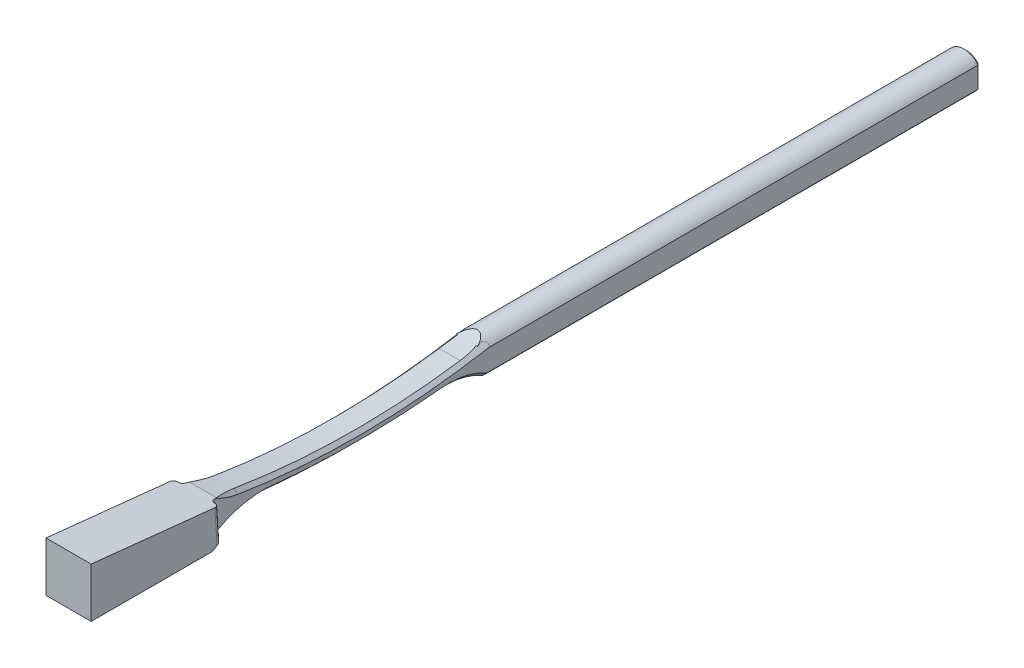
ISO-10303-21;
HEADER;
FILE_DESCRIPTION(('STEP AP214'),'2;1');
FILE_NAME('part.step','',(''),(''),'','','');
FILE_SCHEMA(('AUTOMOTIVE_DESIGN { 1 0 10303 214 1 1 1 1 }'));
ENDSEC;
DATA;
#1=APPLICATION_CONTEXT('core data for automotive mechanical design processes');
#2=APPLICATION_PROTOCOL_DEFINITION('international standard','automotive_design',2000,#1);
#3=PRODUCT_CONTEXT('',#1,'mechanical');
#4=PRODUCT('Part','Part','',(#3));
#5=PRODUCT_RELATED_PRODUCT_CATEGORY('part','',(#4));
#6=PRODUCT_DEFINITION_FORMATION('','',#4);
#7=PRODUCT_DEFINITION_CONTEXT('part definition',#1,'design');
#8=PRODUCT_DEFINITION('design','',#6,#7);
#9=PRODUCT_DEFINITION_SHAPE('','',#8);
#10=(LENGTH_UNIT() NAMED_UNIT(*) SI_UNIT(.MILLI.,.METRE.));
#11=(NAMED_UNIT(*) PLANE_ANGLE_UNIT() SI_UNIT($,.RADIAN.));
#12=(NAMED_UNIT(*) SI_UNIT($,.STERADIAN.) SOLID_ANGLE_UNIT());
#13=UNCERTAINTY_MEASURE_WITH_UNIT(LENGTH_MEASURE(1.E-05),#10,'distance_accuracy_value','');
#14=(GEOMETRIC_REPRESENTATION_CONTEXT(3) GLOBAL_UNCERTAINTY_ASSIGNED_CONTEXT((#13)) GLOBAL_UNIT_ASSIGNED_CONTEXT((#10,
#11,#12)) REPRESENTATION_CONTEXT('',''));
#15=CARTESIAN_POINT('',(0.,0.,0.));
#16=DIRECTION('',(0.,0.,1.));
#17=DIRECTION('',(1.,0.,0.));
#18=AXIS2_PLACEMENT_3D('',#15,#16,#17);
#19=CARTESIAN_POINT('',(2.54,-14.5808687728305,-31.6915845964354));
#20=DIRECTION('',(-1.,0.,0.));
#21=DIRECTION('',(0.,0.,1.));
#22=AXIS2_PLACEMENT_3D('',#19,#20,#21);
#23=CYLINDRICAL_SURFACE('',#22,17.5079566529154);
#24=CARTESIAN_POINT('',(-1.90498898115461,2.85884661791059,-33.2358880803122));
#25=CARTESIAN_POINT('',(-1.91864747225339,2.88079904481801,-32.9879752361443));
#26=CARTESIAN_POINT('',(-1.93269269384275,2.89746050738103,-32.7396476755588));
#27=CARTESIAN_POINT('',(-1.9615280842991,2.92018578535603,-32.2425496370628));
#28=CARTESIAN_POINT('',(-1.97631825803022,2.92624953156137,-31.9937791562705));
#29=CARTESIAN_POINT('',(-2.02176469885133,2.92852036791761,-31.2473627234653));
#30=CARTESIAN_POINT('',(-2.05349549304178,2.90880482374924,-30.74963702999));
#31=CARTESIAN_POINT('',(-2.1188238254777,2.8279581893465,-29.7684059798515));
#32=CARTESIAN_POINT('',(-2.1523678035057,2.76771033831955,-29.2848222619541));
#33=CARTESIAN_POINT('',(-2.22163156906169,2.6071762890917,-28.3246327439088));
#34=CARTESIAN_POINT('',(-2.25735044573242,2.50690675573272,-27.8480241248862));
#35=CARTESIAN_POINT('',(-2.31345821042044,2.32341384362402,-27.1264486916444));
#36=CARTESIAN_POINT('',(-2.33317303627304,2.25428114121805,-26.8777609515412));
#37=CARTESIAN_POINT('',(-2.37308794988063,2.10511618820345,-26.383763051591));
#38=CARTESIAN_POINT('',(-2.39328793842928,2.02508615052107,-26.1384522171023));
#39=CARTESIAN_POINT('',(-2.45501905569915,1.7669352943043,-25.4026859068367));
#40=CARTESIAN_POINT('',(-2.49724048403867,1.57219373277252,-24.9180642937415));
#41=CARTESIAN_POINT('',(-2.5402,1.35609669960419,-24.4430207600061));
#42=B_SPLINE_CURVE_WITH_KNOTS('',3,(#24,#25,#26,#27,#28,#29,#30,#31,#32,#33,#34,#35,#36,#37,#38,
#39,#40,#41),.UNSPECIFIED.,.F.,.F.,(4,2,2,2,2,2,2,2,4),(0.,0.747650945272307,1.49530677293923,
2.9906943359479,4.45450820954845,5.91771319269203,6.69410651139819,7.47034240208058,
9.04034075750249),.UNSPECIFIED.);
#43=CARTESIAN_POINT('',(-1.90500000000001,2.85886432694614,-33.2356880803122));
#44=VERTEX_POINT('',#43);
#45=CARTESIAN_POINT('',(-2.54,1.35710249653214,-24.4452325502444));
#46=VERTEX_POINT('',#45);
#47=EDGE_CURVE('E1100',#44,#46,#42,.T.);
#48=ORIENTED_EDGE('',*,*,#47,.F.);
#49=DIRECTION('',(-1.,0.,0.));
#50=VECTOR('',#49,1.);
#51=CARTESIAN_POINT('',(2.54,2.85886432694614,-33.2356880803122));
#52=LINE('',#51,#50);
#53=CARTESIAN_POINT('',(1.90500000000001,2.85886432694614,-33.2356880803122));
#54=VERTEX_POINT('',#53);
#55=EDGE_CURVE('E675',#54,#44,#52,.T.);
#56=ORIENTED_EDGE('',*,*,#55,.F.);
#57=CARTESIAN_POINT('',(1.90498898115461,2.85884661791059,-33.2358880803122));
#58=CARTESIAN_POINT('',(1.91864747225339,2.88079904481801,-32.9879752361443));
#59=CARTESIAN_POINT('',(1.93269269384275,2.89746050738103,-32.7396476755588));
#60=CARTESIAN_POINT('',(1.9615280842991,2.92018578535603,-32.2425496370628));
#61=CARTESIAN_POINT('',(1.97631825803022,2.92624953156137,-31.9937791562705));
#62=CARTESIAN_POINT('',(2.02176469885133,2.92852036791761,-31.2473627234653));
#63=CARTESIAN_POINT('',(2.05349549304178,2.90880482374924,-30.74963702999));
#64=CARTESIAN_POINT('',(2.1188238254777,2.8279581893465,-29.7684059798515));
#65=CARTESIAN_POINT('',(2.1523678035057,2.76771033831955,-29.2848222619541));
#66=CARTESIAN_POINT('',(2.22163156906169,2.6071762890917,-28.3246327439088));
#67=CARTESIAN_POINT('',(2.25735044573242,2.50690675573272,-27.8480241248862));
#68=CARTESIAN_POINT('',(2.31345821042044,2.32341384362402,-27.1264486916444));
#69=CARTESIAN_POINT('',(2.33317303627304,2.25428114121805,-26.8777609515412));
#70=CARTESIAN_POINT('',(2.37308794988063,2.10511618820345,-26.383763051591));
#71=CARTESIAN_POINT('',(2.39328793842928,2.02508615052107,-26.1384522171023));
#72=CARTESIAN_POINT('',(2.45501905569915,1.7669352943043,-25.4026859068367));
#73=CARTESIAN_POINT('',(2.49724048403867,1.57219373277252,-24.9180642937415));
#74=CARTESIAN_POINT('',(2.5402,1.35609669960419,-24.4430207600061));
#75=B_SPLINE_CURVE_WITH_KNOTS('',3,(#57,#58,#59,#60,#61,#62,#63,#64,#65,#66,#67,#68,#69,#70,#71,
#72,#73,#74),.UNSPECIFIED.,.F.,.F.,(4,2,2,2,2,2,2,2,4),(0.,0.747650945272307,1.49530677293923,
2.9906943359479,4.45450820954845,5.91771319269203,6.69410651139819,7.47034240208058,
9.04034075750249),.UNSPECIFIED.);
#76=CARTESIAN_POINT('',(2.54,1.35710249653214,-24.4452325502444));
#77=VERTEX_POINT('',#76);
#78=EDGE_CURVE('E607',#54,#77,#75,.T.);
#79=ORIENTED_EDGE('',*,*,#78,.T.);
#80=CARTESIAN_POINT('',(2.54,-14.5808687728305,-31.6915845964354));
#81=DIRECTION('',(-1.,0.,0.));
#82=DIRECTION('',(0.,0.,-1.));
#83=AXIS2_PLACEMENT_3D('',#80,#81,#82);
#84=CIRCLE('',#83,17.5079566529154);
#85=CARTESIAN_POINT('',(2.54000000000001,1.27624007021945,-24.269950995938));
#86=VERTEX_POINT('',#85);
#87=EDGE_CURVE('E681',#86,#77,#84,.T.);
#88=ORIENTED_EDGE('',*,*,#87,.F.);
#89=CARTESIAN_POINT('',(3.302,0.90886001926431,-23.5308954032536));
#90=CARTESIAN_POINT('',(3.34218000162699,0.908861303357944,-23.5308975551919));
#91=CARTESIAN_POINT('',(3.38239267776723,0.910489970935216,-23.5339868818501));
#92=CARTESIAN_POINT('',(3.46165584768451,0.91692548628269,-23.5462199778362));
#93=CARTESIAN_POINT('',(3.50070473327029,0.921736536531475,-23.5553717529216));
#94=CARTESIAN_POINT('',(3.57642196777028,0.934281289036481,-23.579319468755));
#95=CARTESIAN_POINT('',(3.6130958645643,0.942007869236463,-23.5941016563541));
#96=CARTESIAN_POINT('',(3.68325184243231,0.960031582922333,-23.62874751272));
#97=CARTESIAN_POINT('',(3.71673420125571,0.970328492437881,-23.6486107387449));
#98=CARTESIAN_POINT('',(3.78100604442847,0.993514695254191,-23.6935980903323));
#99=CARTESIAN_POINT('',(3.81164560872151,1.0064873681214,-23.7188929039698));
#100=CARTESIAN_POINT('',(3.86815689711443,1.03428282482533,-23.7734709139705));
#101=CARTESIAN_POINT('',(3.89402705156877,1.04910621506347,-23.8027554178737));
#102=CARTESIAN_POINT('',(3.94245784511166,1.081390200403,-23.867034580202));
#103=CARTESIAN_POINT('',(3.96458256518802,1.09896709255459,-23.902299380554));
#104=CARTESIAN_POINT('',(4.00239626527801,1.1351801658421,-23.9756254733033));
#105=CARTESIAN_POINT('',(4.01808293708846,1.15381672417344,-24.0136877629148));
#106=CARTESIAN_POINT('',(4.04359408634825,1.19291483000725,-24.0943196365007));
#107=CARTESIAN_POINT('',(4.05294915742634,1.21341445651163,-24.1370198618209));
#108=CARTESIAN_POINT('',(4.06381150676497,1.25444165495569,-24.2234002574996));
#109=CARTESIAN_POINT('',(4.06531716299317,1.27496923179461,-24.2670806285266));
#110=CARTESIAN_POINT('',(4.0603140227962,1.31601738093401,-24.3553739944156));
#111=CARTESIAN_POINT('',(4.05359750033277,1.33652411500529,-24.3999819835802));
#112=CARTESIAN_POINT('',(4.03182935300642,1.37639608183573,-24.4876576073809));
#113=CARTESIAN_POINT('',(4.01677825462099,1.39576138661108,-24.5307253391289));
#114=CARTESIAN_POINT('',(3.97902186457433,1.4323520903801,-24.6129348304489));
#115=CARTESIAN_POINT('',(3.95650439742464,1.4496170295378,-24.6521449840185));
#116=CARTESIAN_POINT('',(3.90419806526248,1.48201200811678,-24.7263819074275));
#117=CARTESIAN_POINT('',(3.87441155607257,1.49714273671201,-24.7614100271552));
#118=CARTESIAN_POINT('',(3.81015794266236,1.52403183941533,-24.8241378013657));
#119=CARTESIAN_POINT('',(3.77604080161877,1.53593044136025,-24.8521356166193));
#120=CARTESIAN_POINT('',(3.70291226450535,1.55704541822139,-24.9021067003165));
#121=CARTESIAN_POINT('',(3.6639027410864,1.56626281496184,-24.9240822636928));
#122=CARTESIAN_POINT('',(3.58458984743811,1.58127035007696,-24.9600050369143));
#123=CARTESIAN_POINT('',(3.54449801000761,1.58723037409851,-24.9743488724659));
#124=CARTESIAN_POINT('',(3.46221305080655,1.59634545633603,-24.9963303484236));
#125=CARTESIAN_POINT('',(3.42002050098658,1.59950127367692,-25.0039698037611));
#126=CARTESIAN_POINT('',(3.33654828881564,1.60284639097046,-25.0120690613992));
#127=CARTESIAN_POINT('',(3.29529959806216,1.60314927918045,-25.0128037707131));
#128=CARTESIAN_POINT('',(3.2132701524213,1.60107677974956,-25.0077839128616));
#129=CARTESIAN_POINT('',(3.17248934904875,1.59870167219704,-25.0020300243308));
#130=CARTESIAN_POINT('',(3.09299915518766,1.59137957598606,-24.9843483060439));
#131=CARTESIAN_POINT('',(3.05427220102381,1.58646052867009,-24.9724875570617));
#132=CARTESIAN_POINT('',(2.97946575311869,1.57419846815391,-24.9430587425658));
#133=CARTESIAN_POINT('',(2.94338639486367,1.56685533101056,-24.9254903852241));
#134=CARTESIAN_POINT('',(2.8741218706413,1.54977058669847,-24.8848590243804));
#135=CARTESIAN_POINT('',(2.84100567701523,1.53998558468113,-24.861696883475));
#136=CARTESIAN_POINT('',(2.77924374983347,1.51834196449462,-24.8108344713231));
#137=CARTESIAN_POINT('',(2.75059879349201,1.50648298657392,-24.7831334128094));
#138=CARTESIAN_POINT('',(2.69722855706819,1.48041655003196,-24.7227406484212));
#139=CARTESIAN_POINT('',(2.67272973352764,1.46612901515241,-24.6898835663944));
#140=CARTESIAN_POINT('',(2.62971375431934,1.43595587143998,-24.6211331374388));
#141=CARTESIAN_POINT('',(2.61119810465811,1.42006986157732,-24.5852390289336));
#142=CARTESIAN_POINT('',(2.57955359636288,1.38612307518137,-24.509276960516));
#143=CARTESIAN_POINT('',(2.56679361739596,1.36798987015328,-24.4690876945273));
#144=CARTESIAN_POINT('',(2.5484365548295,1.3307993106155,-24.3875188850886));
#145=CARTESIAN_POINT('',(2.54284150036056,1.31174169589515,-24.3461390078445));
#146=CARTESIAN_POINT('',(2.53873069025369,1.27214578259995,-24.2610536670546));
#147=CARTESIAN_POINT('',(2.54060428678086,1.25158243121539,-24.2173407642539));
#148=CARTESIAN_POINT('',(2.55221381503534,1.21050535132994,-24.1309404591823));
#149=CARTESIAN_POINT('',(2.56195149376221,1.18999163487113,-24.0882532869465));
#150=CARTESIAN_POINT('',(2.58941408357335,1.14911290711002,-24.0040319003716));
#151=CARTESIAN_POINT('',(2.60732867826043,1.12876382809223,-23.9625514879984));
#152=CARTESIAN_POINT('',(2.65084363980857,1.08942921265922,-23.8831101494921));
#153=CARTESIAN_POINT('',(2.67644363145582,1.0704436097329,-23.8451490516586));
#154=CARTESIAN_POINT('',(2.73406477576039,1.03503253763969,-23.774913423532));
#155=CARTESIAN_POINT('',(2.76590767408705,1.01855457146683,-23.74251960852));
#156=CARTESIAN_POINT('',(2.83568101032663,0.988332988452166,-23.6834883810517));
#157=CARTESIAN_POINT('',(2.87361020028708,0.974588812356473,-23.6568497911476));
#158=CARTESIAN_POINT('',(2.95154678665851,0.951439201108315,-23.6121945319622));
#159=CARTESIAN_POINT('',(2.99120440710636,0.941791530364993,-23.5936929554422));
#160=CARTESIAN_POINT('',(3.07364200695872,0.926010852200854,-23.5635144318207));
#161=CARTESIAN_POINT('',(3.11641522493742,0.919870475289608,-23.5518231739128));
#162=CARTESIAN_POINT('',(3.18334744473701,0.913405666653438,-23.5395280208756));
#163=CARTESIAN_POINT('',(3.20692533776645,0.911704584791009,-23.5362965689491));
#164=CARTESIAN_POINT('',(3.25433165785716,0.909431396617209,-23.5319796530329));
#165=CARTESIAN_POINT('',(3.27816007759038,0.908859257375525,-23.5308941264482));
#166=CARTESIAN_POINT('',(3.302,0.90886001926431,-23.5308954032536));
#167=B_SPLINE_CURVE_WITH_KNOTS('',3,(#89,#90,#91,#92,#93,#94,#95,#96,#97,#98,#99,#100,#101,#102,
#103,#104,#105,#106,#107,#108,#109,#110,#111,#112,#113,#114,#115,#116,#117,#118,#119,#120,#121,
#122,#123,#124,#125,#126,#127,#128,#129,#130,#131,#132,#133,#134,#135,#136,#137,#138,#139,#140,
#141,#142,#143,#144,#145,#146,#147,#148,#149,#150,#151,#152,#153,#154,#155,#156,#157,#158,#159,
#160,#161,#162,#163,#164,#165,#166),.UNSPECIFIED.,.T.,.F.,(4,2,2,2,2,2,2,2,2,2,2,2,2,2,2,2,2,2,
2,2,2,2,2,2,2,2,2,2,2,2,2,2,2,2,2,2,2,2,4),(0.,0.120448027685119,0.241055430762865,
0.36137010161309,0.481674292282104,0.606532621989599,0.731431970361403,0.866416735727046,
1.00144985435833,1.14563552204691,1.28985098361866,1.43778632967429,1.58571233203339,
1.7301684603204,1.87457783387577,2.01100070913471,2.14737152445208,2.27571026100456,
2.40401424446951,2.52718716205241,2.65034719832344,2.77218236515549,2.89402376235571,
3.01820746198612,3.14241272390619,3.27205471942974,3.40172932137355,3.53882433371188,
3.6759581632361,3.82033207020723,3.96473805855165,4.11267894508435,4.26061261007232,
4.40481481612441,4.54898749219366,4.6827125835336,4.81615564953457,4.88762292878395,
4.95908812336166),.UNSPECIFIED.);
#168=CARTESIAN_POINT('',(3.31470000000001,0.90891399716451,-23.5309978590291));
#169=VERTEX_POINT('',#168);
#170=EDGE_CURVE('E602',#86,#169,#167,.T.);
#171=ORIENTED_EDGE('',*,*,#170,.T.);
#172=CARTESIAN_POINT('',(4.08940000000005,0.498207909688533,-22.7949564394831));
#173=CARTESIAN_POINT('',(4.08939858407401,0.471155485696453,-22.7491054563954));
#174=CARTESIAN_POINT('',(4.08494005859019,0.443867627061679,-22.7033369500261));
#175=CARTESIAN_POINT('',(4.0672356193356,0.389608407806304,-22.6132513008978));
#176=CARTESIAN_POINT('',(4.05397409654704,0.362637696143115,-22.5689368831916));
#177=CARTESIAN_POINT('',(4.01882151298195,0.309843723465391,-22.483014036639));
#178=CARTESIAN_POINT('',(3.99691861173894,0.28402209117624,-22.4414094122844));
#179=CARTESIAN_POINT('',(3.94476747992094,0.234529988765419,-22.3623466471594));
#180=CARTESIAN_POINT('',(3.91452340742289,0.210858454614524,-22.3248864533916));
#181=CARTESIAN_POINT('',(3.84802464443,0.167949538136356,-22.2574753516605));
#182=CARTESIAN_POINT('',(3.81218233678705,0.148541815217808,-22.2272283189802));
#183=CARTESIAN_POINT('',(3.7342198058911,0.113694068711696,-22.1732126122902));
#184=CARTESIAN_POINT('',(3.69210617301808,0.0982499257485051,-22.149437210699));
#185=CARTESIAN_POINT('',(3.60854047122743,0.0740308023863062,-22.1122894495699));
#186=CARTESIAN_POINT('',(3.56767735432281,0.0646596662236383,-22.0979821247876));
#187=CARTESIAN_POINT('',(3.48343238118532,0.0503749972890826,-22.0762101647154));
#188=CARTESIAN_POINT('',(3.44005307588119,0.0454570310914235,-22.0687387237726));
#189=CARTESIAN_POINT('',(3.35761630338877,0.0407302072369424,-22.0615584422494));
#190=CARTESIAN_POINT('',(3.31865837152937,0.0403833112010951,-22.061032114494));
#191=CARTESIAN_POINT('',(3.24123765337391,0.0434374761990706,-22.0656705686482));
#192=CARTESIAN_POINT('',(3.20277475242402,0.0468376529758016,-22.0708340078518));
#193=CARTESIAN_POINT('',(3.1288173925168,0.0570009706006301,-22.0863050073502));
#194=CARTESIAN_POINT('',(3.09326608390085,0.0636412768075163,-22.096424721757));
#195=CARTESIAN_POINT('',(3.02453824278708,0.0798883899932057,-22.1212677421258));
#196=CARTESIAN_POINT('',(2.99136211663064,0.0894957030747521,-22.1359918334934));
#197=CARTESIAN_POINT('',(2.92620593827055,0.111894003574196,-22.1704652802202));
#198=CARTESIAN_POINT('',(2.894406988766,0.124837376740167,-22.1904566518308));
#199=CARTESIAN_POINT('',(2.83474315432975,0.153057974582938,-22.2342790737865));
#200=CARTESIAN_POINT('',(2.80687987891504,0.168336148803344,-22.2581116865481));
#201=CARTESIAN_POINT('',(2.75250933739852,0.202570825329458,-22.3118413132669));
#202=CARTESIAN_POINT('',(2.72651855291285,0.221748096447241,-22.3421199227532));
#203=CARTESIAN_POINT('',(2.68016169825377,0.261740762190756,-22.4057404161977));
#204=CARTESIAN_POINT('',(2.65979839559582,0.282556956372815,-22.4390837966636));
#205=CARTESIAN_POINT('',(2.62279858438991,0.327825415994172,-22.5121814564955));
#206=CARTESIAN_POINT('',(2.60689995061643,0.352414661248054,-22.5522253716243));
#207=CARTESIAN_POINT('',(2.5825812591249,0.402242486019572,-22.6341442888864));
#208=CARTESIAN_POINT('',(2.57416448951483,0.427481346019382,-22.6760200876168));
#209=CARTESIAN_POINT('',(2.5646094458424,0.479869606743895,-22.763790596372));
#210=CARTESIAN_POINT('',(2.56406573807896,0.507020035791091,-22.809750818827));
#211=CARTESIAN_POINT('',(2.57192628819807,0.560574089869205,-22.9013587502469));
#212=CARTESIAN_POINT('',(2.58033198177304,0.586977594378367,-22.9470064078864));
#213=CARTESIAN_POINT('',(2.60612411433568,0.638256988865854,-23.0365619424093));
#214=CARTESIAN_POINT('',(2.6235030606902,0.663134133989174,-23.0804712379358));
#215=CARTESIAN_POINT('',(2.66711027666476,0.710594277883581,-23.1650346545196));
#216=CARTESIAN_POINT('',(2.69333518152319,0.733178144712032,-23.2056900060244));
#217=CARTESIAN_POINT('',(2.75203804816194,0.77374927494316,-23.2793377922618));
#218=CARTESIAN_POINT('',(2.78394324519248,0.791948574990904,-23.3126687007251));
#219=CARTESIAN_POINT('',(2.85431237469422,0.824994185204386,-23.3735839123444));
#220=CARTESIAN_POINT('',(2.8927714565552,0.839842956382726,-23.4011724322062));
#221=CARTESIAN_POINT('',(2.97096465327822,0.86427587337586,-23.4467888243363));
#222=CARTESIAN_POINT('',(3.01018290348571,0.874238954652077,-23.4654985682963));
#223=CARTESIAN_POINT('',(3.09184796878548,0.890569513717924,-23.496253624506));
#224=CARTESIAN_POINT('',(3.13429282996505,0.896939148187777,-23.5083029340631));
#225=CARTESIAN_POINT('',(3.21739692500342,0.905454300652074,-23.5244296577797));
#226=CARTESIAN_POINT('',(3.25791394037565,0.9079053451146,-23.5290834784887));
#227=CARTESIAN_POINT('',(3.33923999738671,0.909474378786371,-23.5320613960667));
#228=CARTESIAN_POINT('',(3.38004895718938,0.908593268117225,-23.5303872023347));
#229=CARTESIAN_POINT('',(3.45927179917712,0.903622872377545,-23.5209609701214));
#230=CARTESIAN_POINT('',(3.49771925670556,0.899648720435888,-23.513427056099));
#231=CARTESIAN_POINT('',(3.57267491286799,0.888768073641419,-23.4928641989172));
#232=CARTESIAN_POINT('',(3.60918306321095,0.881861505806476,-23.4798351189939));
#233=CARTESIAN_POINT('',(3.6799525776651,0.865192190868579,-23.448522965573));
#234=CARTESIAN_POINT('',(3.71416410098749,0.855382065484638,-23.4301528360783));
#235=CARTESIAN_POINT('',(3.77886394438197,0.833250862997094,-23.3889339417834));
#236=CARTESIAN_POINT('',(3.80935163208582,0.820929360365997,-23.3660844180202));
#237=CARTESIAN_POINT('',(3.8677710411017,0.793286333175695,-23.3151420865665));
#238=CARTESIAN_POINT('',(3.8954319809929,0.777827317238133,-23.2868139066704));
#239=CARTESIAN_POINT('',(3.94547437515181,0.74486860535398,-23.2268642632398));
#240=CARTESIAN_POINT('',(3.96785258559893,0.72736766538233,-23.1952407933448));
#241=CARTESIAN_POINT('',(4.00879959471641,0.689114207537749,-23.1266654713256));
#242=CARTESIAN_POINT('',(4.02685180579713,0.668210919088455,-23.089489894));
#243=CARTESIAN_POINT('',(4.05619866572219,0.625019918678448,-23.0133701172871));
#244=CARTESIAN_POINT('',(4.06749881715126,0.602733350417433,-22.974427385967));
#245=CARTESIAN_POINT('',(4.08008834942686,0.566619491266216,-22.911899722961));
#246=CARTESIAN_POINT('',(4.0835829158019,0.553074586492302,-22.8885716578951));
#247=CARTESIAN_POINT('',(4.08823910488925,0.525776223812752,-22.8418073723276));
#248=CARTESIAN_POINT('',(4.08940072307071,0.512022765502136,-22.8183711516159));
#249=CARTESIAN_POINT('',(4.08940000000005,0.498207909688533,-22.7949564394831));
#250=B_SPLINE_CURVE_WITH_KNOTS('',3,(#172,#173,#174,#175,#176,#177,#178,#179,#180,#181,#182,
#183,#184,#185,#186,#187,#188,#189,#190,#191,#192,#193,#194,#195,#196,#197,#198,#199,#200,#201,
#202,#203,#204,#205,#206,#207,#208,#209,#210,#211,#212,#213,#214,#215,#216,#217,#218,#219,#220,
#221,#222,#223,#224,#225,#226,#227,#228,#229,#230,#231,#232,#233,#234,#235,#236,#237,#238,#239,
#240,#241,#242,#243,#244,#245,#246,#247,#248,#249),.UNSPECIFIED.,.T.,.F.,(4,2,2,2,2,2,2,2,2,2,2,
2,2,2,2,2,2,2,2,2,2,2,2,2,2,2,2,2,2,2,2,2,2,2,2,2,2,2,4),(0.,0.159612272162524,
0.319508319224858,0.479624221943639,0.639660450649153,0.79106131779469,0.942304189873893,
1.07443411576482,1.20643235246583,1.32273292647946,1.43900606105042,1.5511784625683,
1.66337000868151,1.78207146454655,1.90082132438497,2.03310536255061,2.16545434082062,
2.31364565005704,2.46190205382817,2.62130085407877,2.78072522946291,2.9400167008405,
3.09924765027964,3.24722754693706,3.39509839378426,3.52812008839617,3.66106186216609,
3.78301958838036,3.90494437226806,4.02253588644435,4.14013032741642,4.25976065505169,
4.3794112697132,4.50638766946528,4.63344183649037,4.77180858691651,4.91006242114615,
4.99157142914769,5.07308059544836),.UNSPECIFIED.);
#251=CARTESIAN_POINT('',(4.08940000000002,0.498207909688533,-22.7949564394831));
#252=VERTEX_POINT('',#251);
#253=EDGE_CURVE('E596',#169,#252,#250,.T.);
#254=ORIENTED_EDGE('',*,*,#253,.T.);
#255=CARTESIAN_POINT('',(4.0894,-14.5808687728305,-31.6915845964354));
#256=DIRECTION('',(-1.,0.,0.));
#257=DIRECTION('',(0.,0.,-1.));
#258=AXIS2_PLACEMENT_3D('',#255,#256,#257);
#259=CIRCLE('',#258,17.5079566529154);
#260=CARTESIAN_POINT('',(4.0894,0.,-22.0000000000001));
#261=VERTEX_POINT('',#260);
#262=EDGE_CURVE('E687',#261,#252,#259,.T.);
#263=ORIENTED_EDGE('',*,*,#262,.F.);
#264=DIRECTION('',(-1.,0.,0.));
#265=VECTOR('',#264,1.);
#266=CARTESIAN_POINT('',(2.54,0.,-22.0000000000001));
#267=LINE('',#266,#265);
#268=CARTESIAN_POINT('',(-4.0894,0.,-22.0000000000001));
#269=VERTEX_POINT('',#268);
#270=EDGE_CURVE('E672',#261,#269,#267,.T.);
#271=ORIENTED_EDGE('',*,*,#270,.T.);
#272=CARTESIAN_POINT('',(-4.0894,-14.5808687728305,-31.6915845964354));
#273=DIRECTION('',(-1.,0.,0.));
#274=DIRECTION('',(0.,0.,-1.));
#275=AXIS2_PLACEMENT_3D('',#272,#273,#274);
#276=CIRCLE('',#275,17.5079566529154);
#277=CARTESIAN_POINT('',(-4.08940000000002,0.498207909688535,-22.7949564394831));
#278=VERTEX_POINT('',#277);
#279=EDGE_CURVE('E691',#269,#278,#276,.T.);
#280=ORIENTED_EDGE('',*,*,#279,.T.);
#281=CARTESIAN_POINT('',(-4.08940000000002,0.498207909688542,-22.7949564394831));
#282=CARTESIAN_POINT('',(-4.08942010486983,0.524448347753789,-22.8394139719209));
#283=CARTESIAN_POINT('',(-4.085212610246,0.550497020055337,-22.8840311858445));
#284=CARTESIAN_POINT('',(-4.06831873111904,0.601598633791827,-22.9724240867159));
#285=CARTESIAN_POINT('',(-4.05560289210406,0.626647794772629,-23.0161963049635));
#286=CARTESIAN_POINT('',(-4.0216311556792,0.674998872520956,-23.1015042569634));
#287=CARTESIAN_POINT('',(-4.00035653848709,0.698296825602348,-23.1430348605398));
#288=CARTESIAN_POINT('',(-3.94954386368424,0.742304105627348,-23.2221713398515));
#289=CARTESIAN_POINT('',(-3.92001857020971,0.763017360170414,-23.2597831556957));
#290=CARTESIAN_POINT('',(-3.855678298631,0.799755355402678,-23.3269977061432));
#291=CARTESIAN_POINT('',(-3.82139326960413,0.816009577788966,-23.3569810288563));
#292=CARTESIAN_POINT('',(-3.74701623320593,0.845052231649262,-23.4108571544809));
#293=CARTESIAN_POINT('',(-3.70692535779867,0.857841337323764,-23.4347511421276));
#294=CARTESIAN_POINT('',(-3.62642847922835,0.878334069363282,-23.4731892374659));
#295=CARTESIAN_POINT('',(-3.5864478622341,0.886416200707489,-23.4884255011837));
#296=CARTESIAN_POINT('',(-3.50404398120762,0.899006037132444,-23.5122076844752));
#297=CARTESIAN_POINT('',(-3.46162547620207,0.903520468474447,-23.5207661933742));
#298=CARTESIAN_POINT('',(-3.4014843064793,0.907228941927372,-23.5278000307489));
#299=CARTESIAN_POINT('',(-3.38415485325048,0.907990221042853,-23.5292445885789));
#300=CARTESIAN_POINT('',(-3.34944943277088,0.908905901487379,-23.5309824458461));
#301=CARTESIAN_POINT('',(-3.3320735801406,0.909061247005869,-23.5312775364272));
#302=CARTESIAN_POINT('',(-3.31470000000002,0.908913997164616,-23.5309978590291));
#303=B_SPLINE_CURVE_WITH_KNOTS('',3,(#281,#282,#283,#284,#285,#286,#287,#288,#289,#290,#291,
#292,#293,#294,#295,#296,#297,#298,#299,#300,#301,#302),.UNSPECIFIED.,.F.,.F.,(4,2,2,2,2,2,2,2,
2,2,4),(0.,0.154764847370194,0.310068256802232,0.465713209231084,0.621118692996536,
0.76539968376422,0.909652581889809,1.03960247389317,1.16930678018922,1.22148630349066,
1.2735844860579),.UNSPECIFIED.);
#304=CARTESIAN_POINT('',(-3.31470000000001,0.908913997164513,-23.5309978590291));
#305=VERTEX_POINT('',#304);
#306=EDGE_CURVE('E577',#278,#305,#303,.T.);
#307=ORIENTED_EDGE('',*,*,#306,.T.);
#308=CARTESIAN_POINT('',(-3.30200000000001,0.908860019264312,-23.5308954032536));
#309=CARTESIAN_POINT('',(-3.26181999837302,0.908861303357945,-23.5308975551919));
#310=CARTESIAN_POINT('',(-3.22160732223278,0.910489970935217,-23.5339868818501));
#311=CARTESIAN_POINT('',(-3.1423441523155,0.91692548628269,-23.5462199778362));
#312=CARTESIAN_POINT('',(-3.10329526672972,0.921736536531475,-23.5553717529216));
#313=CARTESIAN_POINT('',(-3.02757803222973,0.934281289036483,-23.579319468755));
#314=CARTESIAN_POINT('',(-2.99090413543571,0.942007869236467,-23.5941016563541));
#315=CARTESIAN_POINT('',(-2.9207481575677,0.960031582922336,-23.62874751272));
#316=CARTESIAN_POINT('',(-2.8872657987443,0.97032849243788,-23.648610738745));
#317=CARTESIAN_POINT('',(-2.82299395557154,0.993514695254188,-23.6935980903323));
#318=CARTESIAN_POINT('',(-2.7923543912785,1.0064873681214,-23.7188929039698));
#319=CARTESIAN_POINT('',(-2.73584310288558,1.03428282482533,-23.7734709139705));
#320=CARTESIAN_POINT('',(-2.70997294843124,1.04910621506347,-23.8027554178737));
#321=CARTESIAN_POINT('',(-2.66154215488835,1.081390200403,-23.867034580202));
#322=CARTESIAN_POINT('',(-2.63941743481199,1.09896709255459,-23.902299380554));
#323=CARTESIAN_POINT('',(-2.601603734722,1.1351801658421,-23.9756254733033));
#324=CARTESIAN_POINT('',(-2.58591706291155,1.15381672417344,-24.0136877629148));
#325=CARTESIAN_POINT('',(-2.56040591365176,1.19291483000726,-24.0943196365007));
#326=CARTESIAN_POINT('',(-2.55105084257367,1.21341445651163,-24.1370198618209));
#327=CARTESIAN_POINT('',(-2.54018849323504,1.25444165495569,-24.2234002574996));
#328=CARTESIAN_POINT('',(-2.53868283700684,1.2749692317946,-24.2670806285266));
#329=CARTESIAN_POINT('',(-2.54368597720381,1.31601738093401,-24.3553739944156));
#330=CARTESIAN_POINT('',(-2.55040249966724,1.33652411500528,-24.3999819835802));
#331=CARTESIAN_POINT('',(-2.57217064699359,1.37639608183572,-24.4876576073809));
#332=CARTESIAN_POINT('',(-2.58722174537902,1.39576138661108,-24.5307253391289));
#333=CARTESIAN_POINT('',(-2.62497813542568,1.4323520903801,-24.6129348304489));
#334=CARTESIAN_POINT('',(-2.64749560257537,1.44961702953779,-24.6521449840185));
#335=CARTESIAN_POINT('',(-2.69980193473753,1.48201200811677,-24.7263819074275));
#336=CARTESIAN_POINT('',(-2.72958844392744,1.49714273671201,-24.7614100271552));
#337=CARTESIAN_POINT('',(-2.79384205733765,1.52403183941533,-24.8241378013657));
#338=CARTESIAN_POINT('',(-2.82795919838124,1.53593044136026,-24.8521356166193));
#339=CARTESIAN_POINT('',(-2.90108773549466,1.55704541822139,-24.9021067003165));
#340=CARTESIAN_POINT('',(-2.94009725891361,1.56626281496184,-24.9240822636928));
#341=CARTESIAN_POINT('',(-3.0194101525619,1.58127035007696,-24.9600050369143));
#342=CARTESIAN_POINT('',(-3.0595019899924,1.58723037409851,-24.9743488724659));
#343=CARTESIAN_POINT('',(-3.14178694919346,1.59634545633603,-24.9963303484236));
#344=CARTESIAN_POINT('',(-3.18397949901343,1.59950127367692,-25.003969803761));
#345=CARTESIAN_POINT('',(-3.26745171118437,1.60284639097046,-25.0120690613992));
#346=CARTESIAN_POINT('',(-3.30870040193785,1.60314927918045,-25.0128037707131));
#347=CARTESIAN_POINT('',(-3.39072984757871,1.60107677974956,-25.0077839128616));
#348=CARTESIAN_POINT('',(-3.43151065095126,1.59870167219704,-25.0020300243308));
#349=CARTESIAN_POINT('',(-3.51100084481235,1.59137957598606,-24.9843483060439));
#350=CARTESIAN_POINT('',(-3.5497277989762,1.5864605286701,-24.9724875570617));
#351=CARTESIAN_POINT('',(-3.62453424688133,1.57419846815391,-24.9430587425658));
#352=CARTESIAN_POINT('',(-3.66061360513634,1.56685533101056,-24.9254903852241));
#353=CARTESIAN_POINT('',(-3.72987812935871,1.54977058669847,-24.8848590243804));
#354=CARTESIAN_POINT('',(-3.76299432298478,1.53998558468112,-24.861696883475));
#355=CARTESIAN_POINT('',(-3.82475625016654,1.51834196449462,-24.8108344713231));
#356=CARTESIAN_POINT('',(-3.853401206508,1.50648298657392,-24.7831334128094));
#357=CARTESIAN_POINT('',(-3.90677144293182,1.48041655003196,-24.7227406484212));
#358=CARTESIAN_POINT('',(-3.93127026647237,1.46612901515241,-24.6898835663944));
#359=CARTESIAN_POINT('',(-3.97428624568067,1.43595587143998,-24.6211331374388));
#360=CARTESIAN_POINT('',(-3.9928018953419,1.42006986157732,-24.5852390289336));
#361=CARTESIAN_POINT('',(-4.02444640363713,1.38612307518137,-24.509276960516));
#362=CARTESIAN_POINT('',(-4.03720638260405,1.36798987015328,-24.4690876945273));
#363=CARTESIAN_POINT('',(-4.05556344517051,1.3307993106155,-24.3875188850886));
#364=CARTESIAN_POINT('',(-4.06115849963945,1.31174169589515,-24.3461390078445));
#365=CARTESIAN_POINT('',(-4.06526930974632,1.27214578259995,-24.2610536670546));
#366=CARTESIAN_POINT('',(-4.06339571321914,1.2515824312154,-24.2173407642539));
#367=CARTESIAN_POINT('',(-4.05178618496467,1.21050535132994,-24.1309404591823));
#368=CARTESIAN_POINT('',(-4.0420485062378,1.18999163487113,-24.0882532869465));
#369=CARTESIAN_POINT('',(-4.01458591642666,1.14911290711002,-24.0040319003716));
#370=CARTESIAN_POINT('',(-3.99667132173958,1.12876382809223,-23.9625514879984));
#371=CARTESIAN_POINT('',(-3.95315636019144,1.08942921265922,-23.8831101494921));
#372=CARTESIAN_POINT('',(-3.92755636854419,1.07044360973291,-23.8451490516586));
#373=CARTESIAN_POINT('',(-3.86993522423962,1.03503253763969,-23.774913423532));
#374=CARTESIAN_POINT('',(-3.83809232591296,1.01855457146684,-23.74251960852));
#375=CARTESIAN_POINT('',(-3.76831898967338,0.988332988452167,-23.6834883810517));
#376=CARTESIAN_POINT('',(-3.73038979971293,0.974588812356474,-23.6568497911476));
#377=CARTESIAN_POINT('',(-3.6524532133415,0.951439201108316,-23.6121945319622));
#378=CARTESIAN_POINT('',(-3.61279559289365,0.941791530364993,-23.5936929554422));
#379=CARTESIAN_POINT('',(-3.53035799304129,0.926010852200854,-23.5635144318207));
#380=CARTESIAN_POINT('',(-3.48758477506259,0.919870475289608,-23.5518231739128));
#381=CARTESIAN_POINT('',(-3.420652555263,0.91340566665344,-23.5395280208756));
#382=CARTESIAN_POINT('',(-3.39707466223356,0.911704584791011,-23.5362965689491));
#383=CARTESIAN_POINT('',(-3.34966834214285,0.909431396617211,-23.5319796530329));
#384=CARTESIAN_POINT('',(-3.32583992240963,0.908859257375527,-23.5308941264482));
#385=CARTESIAN_POINT('',(-3.30200000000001,0.908860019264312,-23.5308954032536));
#386=B_SPLINE_CURVE_WITH_KNOTS('',3,(#308,#309,#310,#311,#312,#313,#314,#315,#316,#317,#318,
#319,#320,#321,#322,#323,#324,#325,#326,#327,#328,#329,#330,#331,#332,#333,#334,#335,#336,#337,
#338,#339,#340,#341,#342,#343,#344,#345,#346,#347,#348,#349,#350,#351,#352,#353,#354,#355,#356,
#357,#358,#359,#360,#361,#362,#363,#364,#365,#366,#367,#368,#369,#370,#371,#372,#373,#374,#375,
#376,#377,#378,#379,#380,#381,#382,#383,#384,#385),.UNSPECIFIED.,.T.,.F.,(4,2,2,2,2,2,2,2,2,2,2,
2,2,2,2,2,2,2,2,2,2,2,2,2,2,2,2,2,2,2,2,2,2,2,2,2,2,2,4),(0.,0.12044802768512,0.241055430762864,
0.361370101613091,0.481674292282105,0.606532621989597,0.731431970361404,0.866416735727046,
1.00144985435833,1.14563552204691,1.28985098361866,1.43778632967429,1.58571233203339,
1.7301684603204,1.87457783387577,2.01100070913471,2.14737152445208,2.27571026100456,
2.40401424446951,2.52718716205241,2.65034719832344,2.77218236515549,2.89402376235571,
3.01820746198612,3.14241272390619,3.27205471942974,3.40172932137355,3.53882433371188,
3.6759581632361,3.82033207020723,3.96473805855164,4.11267894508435,4.26061261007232,
4.4048148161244,4.54898749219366,4.68271258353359,4.81615564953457,4.88762292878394,
4.95908812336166),.UNSPECIFIED.);
#387=CARTESIAN_POINT('',(-2.54,1.27624007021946,-24.269950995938));
#388=VERTEX_POINT('',#387);
#389=EDGE_CURVE('E588',#305,#388,#386,.T.);
#390=ORIENTED_EDGE('',*,*,#389,.T.);
#391=CARTESIAN_POINT('',(-2.54,-14.5808687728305,-31.6915845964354));
#392=DIRECTION('',(-1.,0.,0.));
#393=DIRECTION('',(0.,0.,-1.));
#394=AXIS2_PLACEMENT_3D('',#391,#392,#393);
#395=CIRCLE('',#394,17.5079566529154);
#396=EDGE_CURVE('E682',#388,#46,#395,.T.);
#397=ORIENTED_EDGE('',*,*,#396,.T.);
#398=EDGE_LOOP('',(#48,#56,#79,#88,#171,#254,#263,#271,#280,#307,#390,#397));
#399=FACE_BOUND('',#398,.T.);
#400=ADVANCED_FACE('F104',(#399),#23,.F.);
#401=CARTESIAN_POINT('',(2.54,26.7374468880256,-65.9347978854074));
#402=DIRECTION('',(-1.,0.,0.));
#403=DIRECTION('',(0.,0.,1.));
#404=AXIS2_PLACEMENT_3D('',#401,#402,#403);
#405=CYLINDRICAL_SURFACE('',#404,21.6347687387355);
#406=CARTESIAN_POINT('',(-2.54,5.40500000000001,-69.5389521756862));
#407=CARTESIAN_POINT('',(-2.52358608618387,5.42686713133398,-69.6683911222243));
#408=CARTESIAN_POINT('',(-2.50588977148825,5.44989060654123,-69.7974812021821));
#409=CARTESIAN_POINT('',(-2.46754812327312,5.49819950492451,-70.0548361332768));
#410=CARTESIAN_POINT('',(-2.44690192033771,5.52348559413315,-70.1831007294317));
#411=CARTESIAN_POINT('',(-2.40211203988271,5.57646118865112,-70.4395940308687));
#412=CARTESIAN_POINT('',(-2.3779424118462,5.60416785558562,-70.5678146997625));
#413=CARTESIAN_POINT('',(-2.32574319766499,5.66172498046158,-70.8229739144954));
#414=CARTESIAN_POINT('',(-2.29771400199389,5.69157522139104,-70.9499125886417));
#415=CARTESIAN_POINT('',(-2.23665196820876,5.75387480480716,-71.204562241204));
#416=CARTESIAN_POINT('',(-2.20353639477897,5.78636192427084,-71.3322442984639));
#417=CARTESIAN_POINT('',(-2.13194042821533,5.85326529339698,-71.5855796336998));
#418=CARTESIAN_POINT('',(-2.09346068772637,5.88768130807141,-71.7112331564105));
#419=CARTESIAN_POINT('',(-2.01032283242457,5.9580860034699,-71.9595788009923));
#420=CARTESIAN_POINT('',(-1.96568436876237,5.99406944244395,-72.0822789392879));
#421=CARTESIAN_POINT('',(-1.86898543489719,6.06733426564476,-72.3242907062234));
#422=CARTESIAN_POINT('',(-1.81692907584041,6.10461492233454,-72.4436041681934));
#423=CARTESIAN_POINT('',(-1.73295333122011,6.16056007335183,-72.6175012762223));
#424=CARTESIAN_POINT('',(-1.70444062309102,6.17894151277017,-72.673826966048));
#425=CARTESIAN_POINT('',(-1.64509190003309,6.21579035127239,-72.7852195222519));
#426=CARTESIAN_POINT('',(-1.61425556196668,6.23425776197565,-72.8402862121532));
#427=CARTESIAN_POINT('',(-1.51793342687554,6.28962525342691,-73.0032436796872));
#428=CARTESIAN_POINT('',(-1.44861099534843,6.32650669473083,-73.108941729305));
#429=CARTESIAN_POINT('',(-1.2968534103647,6.3993055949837,-73.3128096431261));
#430=CARTESIAN_POINT('',(-1.2142906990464,6.43520923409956,-73.4108908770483));
#431=CARTESIAN_POINT('',(-1.03405813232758,6.5034293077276,-73.5935945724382));
#432=CARTESIAN_POINT('',(-0.936433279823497,6.53575595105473,-73.6782556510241));
#433=CARTESIAN_POINT('',(-0.767391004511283,6.58155494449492,-73.7964466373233));
#434=CARTESIAN_POINT('',(-0.701398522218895,6.5973572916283,-73.8367895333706));
#435=CARTESIAN_POINT('',(-0.563637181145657,6.62535792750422,-73.9077863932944));
#436=CARTESIAN_POINT('',(-0.491874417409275,6.63755995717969,-73.9384504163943));
#437=CARTESIAN_POINT('',(-0.350826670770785,6.65627901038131,-73.98529472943));
#438=CARTESIAN_POINT('',(-0.281976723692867,6.66323271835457,-74.0025915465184));
#439=CARTESIAN_POINT('',(-0.142084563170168,6.67259177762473,-74.0258405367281));
#440=CARTESIAN_POINT('',(-0.071043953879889,6.67500038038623,-74.0318008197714));
#441=CARTESIAN_POINT('',(0.0729158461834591,6.67499960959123,-74.0317991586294));
#442=CARTESIAN_POINT('',(0.145835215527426,6.6724616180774,-74.0255189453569));
#443=CARTESIAN_POINT('',(0.289317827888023,6.66261074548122,-74.0010446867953));
#444=CARTESIAN_POINT('',(0.359878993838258,6.65529376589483,-73.9828404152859));
#445=CARTESIAN_POINT('',(0.496340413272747,6.63671612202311,-73.9363259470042));
#446=CARTESIAN_POINT('',(0.562272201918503,6.6254860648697,-73.9080941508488));
#447=CARTESIAN_POINT('',(0.689253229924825,6.59996043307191,-73.8434053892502));
#448=CARTESIAN_POINT('',(0.750301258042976,6.5856641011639,-73.8069463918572));
#449=CARTESIAN_POINT('',(0.910564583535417,6.54345007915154,-73.6982456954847));
#450=CARTESIAN_POINT('',(1.00471809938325,6.5132633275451,-73.6194465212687));
#451=CARTESIAN_POINT('',(1.17927544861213,6.44934284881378,-73.4490777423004));
#452=CARTESIAN_POINT('',(1.25963353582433,6.41559789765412,-73.3574674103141));
#453=CARTESIAN_POINT('',(1.40287846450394,6.34925886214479,-73.1731589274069));
#454=CARTESIAN_POINT('',(1.46663269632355,6.31677508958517,-73.0810833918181));
#455=CARTESIAN_POINT('',(1.58574345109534,6.25148315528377,-72.8917050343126));
#456=CARTESIAN_POINT('',(1.64109226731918,6.21867472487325,-72.7943975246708));
#457=CARTESIAN_POINT('',(1.74494380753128,6.15322063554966,-72.5954199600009));
#458=CARTESIAN_POINT('',(1.79340589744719,6.12057695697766,-72.4937282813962));
#459=CARTESIAN_POINT('',(1.88417818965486,6.05608946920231,-72.2874627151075));
#460=CARTESIAN_POINT('',(1.92649067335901,6.02424536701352,-72.1828899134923));
#461=CARTESIAN_POINT('',(2.0044686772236,5.96274388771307,-71.9751828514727));
#462=CARTESIAN_POINT('',(2.04031556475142,5.93304899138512,-71.87212723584));
#463=CARTESIAN_POINT('',(2.10776317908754,5.87485520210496,-71.6642955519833));
#464=CARTESIAN_POINT('',(2.13936321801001,5.84635650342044,-71.5595192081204));
#465=CARTESIAN_POINT('',(2.22867878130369,5.76281015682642,-71.2428557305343));
#466=CARTESIAN_POINT('',(2.28082900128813,5.70977857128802,-71.0288572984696));
#467=CARTESIAN_POINT('',(2.37222933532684,5.61128075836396,-70.6032767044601));
#468=CARTESIAN_POINT('',(2.41180858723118,5.56564023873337,-70.3918033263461));
#469=CARTESIAN_POINT('',(2.46454713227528,5.50184503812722,-70.0729308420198));
#470=CARTESIAN_POINT('',(2.48100229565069,5.48138416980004,-69.9665201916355));
#471=CARTESIAN_POINT('',(2.5119336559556,5.44201876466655,-69.753139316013));
#472=CARTESIAN_POINT('',(2.52641011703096,5.42311402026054,-69.6461691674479));
#473=CARTESIAN_POINT('',(2.54,5.40500000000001,-69.5389521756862));
#474=B_SPLINE_CURVE_WITH_KNOTS('',3,(#406,#407,#408,#409,#410,#411,#412,#413,#414,#415,#416,
#417,#418,#419,#420,#421,#422,#423,#424,#425,#426,#427,#428,#429,#430,#431,#432,#433,#434,#435,
#436,#437,#438,#439,#440,#441,#442,#443,#444,#445,#446,#447,#448,#449,#450,#451,#452,#453,#454,
#455,#456,#457,#458,#459,#460,#461,#462,#463,#464,#465,#466,#467,#468,#469,#470,#471,#472,#473),
.UNSPECIFIED.,.F.,.F.,(4,2,2,2,2,2,2,2,2,2,2,2,2,2,2,2,2,2,2,2,2,2,2,2,2,2,2,2,2,2,2,2,2,4),(0.,
0.39688720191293,0.793891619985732,1.19398346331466,1.59403485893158,2.00146310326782,
2.40884182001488,2.81494951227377,3.22083300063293,3.41804374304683,3.61528196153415,
4.00958660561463,4.40794756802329,4.80514056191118,5.0412749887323,5.2771631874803,
5.49016683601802,5.70301804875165,5.92147754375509,6.14012463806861,6.3570985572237,
6.57412612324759,6.95123552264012,7.3295722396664,7.67888438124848,8.0285148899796,
8.3801295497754,8.73161343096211,9.07074221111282,9.40992585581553,10.0890303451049,
10.7485168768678,11.0772973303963,11.406033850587),.UNSPECIFIED.);
#475=CARTESIAN_POINT('',(-1.94663603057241,6.00823307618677,-72.1285780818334));
#476=VERTEX_POINT('',#475);
#477=CARTESIAN_POINT('',(1.94663603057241,6.00823307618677,-72.1285780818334));
#478=VERTEX_POINT('',#477);
#479=EDGE_CURVE('E487',#476,#478,#474,.T.);
#480=ORIENTED_EDGE('',*,*,#479,.F.);
#481=DIRECTION('',(1.,0.,0.));
#482=VECTOR('',#481,1.);
#483=CARTESIAN_POINT('',(-2.1225,6.00823307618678,-72.1285780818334));
#484=LINE('',#483,#482);
#485=CARTESIAN_POINT('',(-1.705,6.00823307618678,-72.1285780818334));
#486=VERTEX_POINT('',#485);
#487=EDGE_CURVE('E1122',#476,#486,#484,.T.);
#488=ORIENTED_EDGE('',*,*,#487,.T.);
#489=CARTESIAN_POINT('',(-0.165785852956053,8.66074258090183,-77.8215964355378));
#490=CARTESIAN_POINT('',(-0.319091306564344,8.42805604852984,-77.4678118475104));
#491=CARTESIAN_POINT('',(-0.463691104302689,8.20403184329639,-77.104433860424));
#492=CARTESIAN_POINT('',(-0.734342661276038,7.77500035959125,-76.359449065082));
#493=CARTESIAN_POINT('',(-0.860375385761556,7.57001267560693,-75.9778240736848));
#494=CARTESIAN_POINT('',(-1.09179458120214,7.18230721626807,-75.2001934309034));
#495=CARTESIAN_POINT('',(-1.19729177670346,6.99947213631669,-74.8042793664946));
#496=CARTESIAN_POINT('',(-1.387307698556,6.65664733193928,-73.9980682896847));
#497=CARTESIAN_POINT('',(-1.47184176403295,6.49664093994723,-73.5877820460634));
#498=CARTESIAN_POINT('',(-1.57572991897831,6.28795814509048,-72.9998376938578));
#499=CARTESIAN_POINT('',(-1.60417682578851,6.22915411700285,-72.8272910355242));
#500=CARTESIAN_POINT('',(-1.65731969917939,6.11574462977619,-72.4801759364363));
#501=CARTESIAN_POINT('',(-1.68201414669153,6.06114087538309,-72.3056067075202));
#502=CARTESIAN_POINT('',(-1.77110126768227,5.85608434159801,-71.6194915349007));
#503=CARTESIAN_POINT('',(-1.82124308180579,5.72173234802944,-71.1010855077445));
#504=CARTESIAN_POINT('',(-1.88819383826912,5.49159370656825,-70.0535933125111));
#505=CARTESIAN_POINT('',(-1.9049997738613,5.39581053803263,-69.5245061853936));
#506=CARTESIAN_POINT('',(-1.905000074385,5.29455924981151,-68.8154186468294));
#507=CARTESIAN_POINT('',(-1.90312982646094,5.27144131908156,-68.6377475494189));
#508=CARTESIAN_POINT('',(-1.89566208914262,5.2296496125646,-68.2821098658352));
#509=CARTESIAN_POINT('',(-1.89006766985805,5.21097219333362,-68.1041436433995));
#510=CARTESIAN_POINT('',(-1.88261631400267,5.19450782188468,-67.9260273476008));
#511=B_SPLINE_CURVE_WITH_KNOTS('',3,(#489,#490,#491,#492,#493,#494,#495,#496,#497,#498,#499,
#500,#501,#502,#503,#504,#505,#506,#507,#508,#509,#510),.UNSPECIFIED.,.F.,.F.,(4,2,2,2,2,2,2,2,
2,2,4),(0.,1.35091187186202,2.70319918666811,4.04797990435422,5.39177369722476,5.94518669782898,
6.49882313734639,8.10976995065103,9.72086205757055,10.2583271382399,10.7953496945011),.UNSPECIFIED.);
#512=CARTESIAN_POINT('',(-1.905,5.31991598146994,-68.992998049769));
#513=VERTEX_POINT('',#512);
#514=EDGE_CURVE('E659',#486,#513,#511,.T.);
#515=ORIENTED_EDGE('',*,*,#514,.T.);
#516=DIRECTION('',(-1.,0.,0.));
#517=VECTOR('',#516,1.);
#518=CARTESIAN_POINT('',(2.54,5.31991598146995,-68.992998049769));
#519=LINE('',#518,#517);
#520=CARTESIAN_POINT('',(1.905,5.31991598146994,-68.992998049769));
#521=VERTEX_POINT('',#520);
#522=EDGE_CURVE('E653',#521,#513,#519,.T.);
#523=ORIENTED_EDGE('',*,*,#522,.F.);
#524=CARTESIAN_POINT('',(0.16578585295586,8.66074258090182,-77.8215964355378));
#525=CARTESIAN_POINT('',(0.319091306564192,8.42805604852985,-77.4678118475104));
#526=CARTESIAN_POINT('',(0.463691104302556,8.20403184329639,-77.104433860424));
#527=CARTESIAN_POINT('',(0.734342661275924,7.77500035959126,-76.359449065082));
#528=CARTESIAN_POINT('',(0.860375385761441,7.57001267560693,-75.9778240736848));
#529=CARTESIAN_POINT('',(1.09179458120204,7.18230721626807,-75.2001934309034));
#530=CARTESIAN_POINT('',(1.19729177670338,6.9994721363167,-74.8042793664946));
#531=CARTESIAN_POINT('',(1.38730769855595,6.65664733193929,-73.9980682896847));
#532=CARTESIAN_POINT('',(1.47184176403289,6.49664093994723,-73.5877820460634));
#533=CARTESIAN_POINT('',(1.57572991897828,6.28795814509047,-72.9998376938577));
#534=CARTESIAN_POINT('',(1.60417682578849,6.22915411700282,-72.8272910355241));
#535=CARTESIAN_POINT('',(1.65731969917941,6.11574462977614,-72.4801759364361));
#536=CARTESIAN_POINT('',(1.68201414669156,6.06114087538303,-72.30560670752));
#537=CARTESIAN_POINT('',(1.77110126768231,5.85608434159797,-71.6194915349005));
#538=CARTESIAN_POINT('',(1.82124308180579,5.72173234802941,-71.1010855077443));
#539=CARTESIAN_POINT('',(1.8881938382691,5.49159370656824,-70.053593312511));
#540=CARTESIAN_POINT('',(1.90499977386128,5.39581053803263,-69.5245061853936));
#541=CARTESIAN_POINT('',(1.905000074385,5.29455924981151,-68.8154186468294));
#542=CARTESIAN_POINT('',(1.90312982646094,5.27144131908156,-68.6377475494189));
#543=CARTESIAN_POINT('',(1.89566208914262,5.2296496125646,-68.2821098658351));
#544=CARTESIAN_POINT('',(1.89006766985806,5.21097219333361,-68.1041436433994));
#545=CARTESIAN_POINT('',(1.88261631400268,5.19450782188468,-67.9260273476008));
#546=B_SPLINE_CURVE_WITH_KNOTS('',3,(#524,#525,#526,#527,#528,#529,#530,#531,#532,#533,#534,
#535,#536,#537,#538,#539,#540,#541,#542,#543,#544,#545),.UNSPECIFIED.,.F.,.F.,(4,2,2,2,2,2,2,2,
2,2,4),(0.,1.35091187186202,2.70319918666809,4.04797990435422,5.39177369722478,5.94518669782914,
6.49882313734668,8.10976995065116,9.72086205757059,10.2583271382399,10.7953496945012),.UNSPECIFIED.);
#547=CARTESIAN_POINT('',(1.705,6.00823307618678,-72.1285780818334));
#548=VERTEX_POINT('',#547);
#549=EDGE_CURVE('E441',#548,#521,#546,.T.);
#550=ORIENTED_EDGE('',*,*,#549,.F.);
#551=DIRECTION('',(1.,0.,0.));
#552=VECTOR('',#551,1.);
#553=CARTESIAN_POINT('',(2.1225,6.00823307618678,-72.1285780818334));
#554=LINE('',#553,#552);
#555=EDGE_CURVE('E655',#478,#548,#554,.F.);
#556=ORIENTED_EDGE('',*,*,#555,.F.);
#557=EDGE_LOOP('',(#480,#488,#515,#523,#550,#556));
#558=FACE_BOUND('',#557,.T.);
#559=ADVANCED_FACE('F560',(#558),#405,.F.);
#560=CARTESIAN_POINT('',(2.54,-10.7976586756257,-66.2295440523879));
#561=DIRECTION('',(1.,0.,0.));
#562=DIRECTION('',(0.,0.,-1.));
#563=AXIS2_PLACEMENT_3D('',#560,#561,#562);
#564=PLANE('',#563);
#565=DIRECTION('',(0.,0.,-1.));
#566=VECTOR('',#565,1.);
#567=CARTESIAN_POINT('',(2.54,1.59500000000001,-62.5000000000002));
#568=LINE('',#567,#566);
#569=CARTESIAN_POINT('',(2.54,1.59500000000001,-73.205801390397));
#570=VERTEX_POINT('',#569);
#571=CARTESIAN_POINT('',(2.54,1.59500000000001,-162.119));
#572=VERTEX_POINT('',#571);
#573=EDGE_CURVE('E517',#570,#572,#568,.T.);
#574=ORIENTED_EDGE('',*,*,#573,.T.);
#575=DIRECTION('',(0.,1.,0.));
#576=VECTOR('',#575,1.);
#577=CARTESIAN_POINT('',(2.54,5.40500000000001,-162.119));
#578=LINE('',#577,#576);
#579=CARTESIAN_POINT('',(2.54,5.40500000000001,-162.119));
#580=VERTEX_POINT('',#579);
#581=EDGE_CURVE('E750',#572,#580,#578,.T.);
#582=ORIENTED_EDGE('',*,*,#581,.T.);
#583=DIRECTION('',(0.,0.,-1.));
#584=VECTOR('',#583,1.);
#585=CARTESIAN_POINT('',(2.54,5.40500000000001,-62.5000000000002));
#586=LINE('',#585,#584);
#587=CARTESIAN_POINT('',(2.54,5.40500000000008,-73.5461386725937));
#588=VERTEX_POINT('',#587);
#589=EDGE_CURVE('E516',#588,#580,#586,.T.);
#590=ORIENTED_EDGE('',*,*,#589,.F.);
#591=CARTESIAN_POINT('',(2.54,138.431285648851,-49.9860819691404));
#592=DIRECTION('',(1.,0.,0.));
#593=DIRECTION('',(0.,0.,-1.));
#594=AXIS2_PLACEMENT_3D('',#591,#592,#593);
#595=CIRCLE('',#594,135.096517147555);
#596=CARTESIAN_POINT('',(2.54,5.14020332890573,-27.9734419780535));
#597=VERTEX_POINT('',#596);
#598=EDGE_CURVE('E748',#597,#588,#595,.T.);
#599=ORIENTED_EDGE('',*,*,#598,.F.);
#600=CARTESIAN_POINT('',(2.54,8.37709165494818,-20.7361292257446));
#601=CARTESIAN_POINT('',(2.54,7.91264613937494,-21.4207389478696));
#602=CARTESIAN_POINT('',(2.54,7.10272214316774,-22.7206038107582));
#603=CARTESIAN_POINT('',(2.54,6.44160572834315,-24.0480673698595));
#604=CARTESIAN_POINT('',(2.54,5.935607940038,-25.2107062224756));
#605=CARTESIAN_POINT('',(2.53999999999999,5.52457687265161,-26.2586943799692));
#606=CARTESIAN_POINT('',(2.54,5.2447023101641,-27.3528658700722));
#607=CARTESIAN_POINT('',(2.54,5.14020332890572,-27.9734419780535));
#608=B_SPLINE_CURVE_WITH_KNOTS('',3,(#600,#601,#602,#603,#604,#605,#606,#607),.UNSPECIFIED.,.F.,
.F.,(4,1,1,1,1,4),(0.,0.28,0.56,0.587065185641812,0.78,1.),.UNSPECIFIED.);
#609=CARTESIAN_POINT('',(2.54,6.47728083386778,-24.0020528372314));
#610=VERTEX_POINT('',#609);
#611=EDGE_CURVE('E1109',#610,#597,#608,.T.);
#612=ORIENTED_EDGE('',*,*,#611,.F.);
#613=DIRECTION('',(0.,0.104528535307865,0.994521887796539));
#614=VECTOR('',#613,1.);
#615=CARTESIAN_POINT('',(2.54,8.99999999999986,0.));
#616=LINE('',#615,#614);
#617=CARTESIAN_POINT('',(2.54000000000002,6.48587612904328,-23.9202741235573));
#618=VERTEX_POINT('',#617);
#619=EDGE_CURVE('E685',#610,#618,#616,.T.);
#620=ORIENTED_EDGE('',*,*,#619,.T.);
#621=DIRECTION('',(0.,0.997754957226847,0.066970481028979));
#622=VECTOR('',#621,1.);
#623=CARTESIAN_POINT('',(2.53999999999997,-9.23082577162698,-24.9751975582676));
#624=LINE('',#623,#622);
#625=EDGE_CURVE('E729',#86,#618,#624,.T.);
#626=ORIENTED_EDGE('',*,*,#625,.F.);
#627=ORIENTED_EDGE('',*,*,#87,.T.);
#628=CARTESIAN_POINT('',(2.54,-13.4161984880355,-32.6918726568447));
#629=DIRECTION('',(1.,0.,0.));
#630=DIRECTION('',(0.,0.,-1.));
#631=AXIS2_PLACEMENT_3D('',#628,#629,#630);
#632=CIRCLE('',#631,16.9191458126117);
#633=CARTESIAN_POINT('',(2.54,3.49271288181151,-33.2802698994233));
#634=VERTEX_POINT('',#633);
#635=EDGE_CURVE('E458',#634,#77,#632,.T.);
#636=ORIENTED_EDGE('',*,*,#635,.F.);
#637=CARTESIAN_POINT('',(2.54,3.49271288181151,-33.2802698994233));
#638=CARTESIAN_POINT('',(2.54,2.86313608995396,-39.1396308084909));
#639=CARTESIAN_POINT('',(2.54,2.34126881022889,-49.7063815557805));
#640=CARTESIAN_POINT('',(2.54,2.90030577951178,-60.2299920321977));
#641=CARTESIAN_POINT('',(2.54,3.35480797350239,-64.8317446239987));
#642=B_SPLINE_CURVE_WITH_KNOTS('',3,(#637,#638,#639,#640,#641),.UNSPECIFIED.,.F.,.F.,(4,1,4),
(0.,0.559999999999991,1.),.UNSPECIFIED.);
#643=CARTESIAN_POINT('',(2.54,3.35480797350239,-64.8317446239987));
#644=VERTEX_POINT('',#643);
#645=EDGE_CURVE('E440',#634,#644,#642,.T.);
#646=ORIENTED_EDGE('',*,*,#645,.T.);
#647=CARTESIAN_POINT('',(2.54,-10.7976586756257,-66.2295440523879));
#648=DIRECTION('',(-1.,0.,0.));
#649=DIRECTION('',(0.,0.,1.));
#650=AXIS2_PLACEMENT_3D('',#647,#648,#649);
#651=CIRCLE('',#650,14.2213274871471);
#652=EDGE_CURVE('E1164',#644,#570,#651,.T.);
#653=ORIENTED_EDGE('',*,*,#652,.T.);
#654=EDGE_LOOP('',(#574,#582,#590,#599,#612,#620,#626,#627,#636,#646,#653));
#655=FACE_BOUND('',#654,.T.);
#656=ADVANCED_FACE('F566',(#655),#564,.T.);
#657=CARTESIAN_POINT('',(2.54,138.431285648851,-49.9860819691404));
#658=DIRECTION('',(-1.,0.,0.));
#659=DIRECTION('',(0.,0.,1.));
#660=AXIS2_PLACEMENT_3D('',#657,#658,#659);
#661=CYLINDRICAL_SURFACE('',#660,134.461517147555);
#662=ORIENTED_EDGE('',*,*,#522,.T.);
#663=CARTESIAN_POINT('',(-1.905,138.431285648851,-49.9860819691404));
#664=DIRECTION('',(-1.,0.,0.));
#665=DIRECTION('',(0.,0.,1.));
#666=AXIS2_PLACEMENT_3D('',#663,#664,#665);
#667=CIRCLE('',#666,134.461517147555);
#668=CARTESIAN_POINT('',(-1.90499999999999,5.76671716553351,-28.0769089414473));
#669=VERTEX_POINT('',#668);
#670=EDGE_CURVE('E1136',#513,#669,#667,.T.);
#671=ORIENTED_EDGE('',*,*,#670,.T.);
#672=CARTESIAN_POINT('',(-1.90499999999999,5.76671716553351,-28.0769089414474));
#673=CARTESIAN_POINT('',(-1.90497487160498,5.78831696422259,-27.9461158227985));
#674=CARTESIAN_POINT('',(-1.90729610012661,5.81010974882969,-27.8153609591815));
#675=CARTESIAN_POINT('',(-1.91643533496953,5.85403883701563,-27.5541689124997));
#676=CARTESIAN_POINT('',(-1.92324987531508,5.87617486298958,-27.4237315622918));
#677=CARTESIAN_POINT('',(-1.9411783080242,5.92077625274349,-27.1632434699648));
#678=CARTESIAN_POINT('',(-1.95229121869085,5.94324154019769,-27.0331926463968));
#679=CARTESIAN_POINT('',(-1.97843121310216,5.98839973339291,-26.7740420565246));
#680=CARTESIAN_POINT('',(-1.99344326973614,6.01109145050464,-26.6449405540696));
#681=CARTESIAN_POINT('',(-2.02703360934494,6.05677443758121,-26.3872365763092));
#682=CARTESIAN_POINT('',(-2.04561248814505,6.07976575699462,-26.258634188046));
#683=CARTESIAN_POINT('',(-2.08593435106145,6.12603496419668,-26.0019780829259));
#684=CARTESIAN_POINT('',(-2.10767740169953,6.1493128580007,-25.8739243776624));
#685=CARTESIAN_POINT('',(-2.14540190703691,6.18754822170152,-25.6653036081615));
#686=CARTESIAN_POINT('',(-2.16056599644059,6.20242115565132,-25.5845715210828));
#687=CARTESIAN_POINT('',(-2.19186778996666,6.23227927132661,-25.4233250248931));
#688=CARTESIAN_POINT('',(-2.20800540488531,6.24726444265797,-25.3428105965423));
#689=CARTESIAN_POINT('',(-2.24113958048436,6.27734914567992,-25.1819824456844));
#690=CARTESIAN_POINT('',(-2.25813612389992,6.29244867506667,-25.1016687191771));
#691=CARTESIAN_POINT('',(-2.29289712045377,6.32280361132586,-24.9410172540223));
#692=CARTESIAN_POINT('',(-2.31066340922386,6.33805931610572,-24.8606799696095));
#693=CARTESIAN_POINT('',(-2.34686805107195,6.36868921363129,-24.7001789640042));
#694=CARTESIAN_POINT('',(-2.36530640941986,6.38406340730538,-24.620015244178));
#695=CARTESIAN_POINT('',(-2.40285838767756,6.41492781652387,-24.4598697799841));
#696=CARTESIAN_POINT('',(-2.42197199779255,6.43041803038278,-24.3798880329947));
#697=CARTESIAN_POINT('',(-2.44142516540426,6.44596530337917,-24.3));
#698=B_SPLINE_CURVE_WITH_KNOTS('',3,(#672,#673,#674,#675,#676,#677,#678,#679,#680,#681,#682,
#683,#684,#685,#686,#687,#688,#689,#690,#691,#692,#693,#694,#695,#696,#697),.UNSPECIFIED.,.F.,
.F.,(4,2,2,2,2,2,2,2,2,2,2,2,4),(0.,0.397663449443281,0.795020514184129,1.19228688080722,
1.58804435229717,1.98386799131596,2.37969995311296,2.63013275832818,2.88054265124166,
3.1309475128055,3.38198649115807,3.63302743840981,3.88406474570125),.UNSPECIFIED.);
#699=CARTESIAN_POINT('',(-2.44142516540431,6.44596530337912,-24.2999999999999));
#700=VERTEX_POINT('',#699);
#701=EDGE_CURVE('E311',#669,#700,#698,.T.);
#702=ORIENTED_EDGE('',*,*,#701,.T.);
#703=DIRECTION('',(-1.,0.,0.));
#704=VECTOR('',#703,1.);
#705=CARTESIAN_POINT('',(2.54,6.44596530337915,-24.2999999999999));
#706=LINE('',#705,#704);
#707=CARTESIAN_POINT('',(2.4414251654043,6.44596530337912,-24.2999999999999));
#708=VERTEX_POINT('',#707);
#709=EDGE_CURVE('E661',#708,#700,#706,.T.);
#710=ORIENTED_EDGE('',*,*,#709,.F.);
#711=CARTESIAN_POINT('',(2.44142516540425,6.44596530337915,-24.3));
#712=CARTESIAN_POINT('',(2.41848076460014,6.42762787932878,-24.3942248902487));
#713=CARTESIAN_POINT('',(2.39600821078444,6.40936989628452,-24.4885798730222));
#714=CARTESIAN_POINT('',(2.35200579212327,6.37301776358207,-24.677531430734));
#715=CARTESIAN_POINT('',(2.33047584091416,6.35492359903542,-24.7721279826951));
#716=CARTESIAN_POINT('',(2.28839222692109,6.31893388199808,-24.9613868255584));
#717=CARTESIAN_POINT('',(2.26783683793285,6.30103802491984,-25.0560486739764));
#718=CARTESIAN_POINT('',(2.2278322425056,6.26540550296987,-25.2456489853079));
#719=CARTESIAN_POINT('',(2.20838317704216,6.24766885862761,-25.3405874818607));
#720=CARTESIAN_POINT('',(2.16103056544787,6.20317429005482,-25.580185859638));
#721=CARTESIAN_POINT('',(2.133987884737,6.17651982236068,-25.7250371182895));
#722=CARTESIAN_POINT('',(2.08360012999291,6.12357579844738,-26.0154480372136));
#723=CARTESIAN_POINT('',(2.06025494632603,6.09728623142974,-26.1610076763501));
#724=CARTESIAN_POINT('',(2.01788887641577,6.04508632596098,-26.452791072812));
#725=CARTESIAN_POINT('',(1.99886693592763,6.01917589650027,-26.5990146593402));
#726=CARTESIAN_POINT('',(1.96563102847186,5.96764477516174,-26.8926683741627));
#727=CARTESIAN_POINT('',(1.9514364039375,5.94202563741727,-27.040100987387));
#728=CARTESIAN_POINT('',(1.92848265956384,5.89120129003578,-27.3355170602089));
#729=CARTESIAN_POINT('',(1.9197253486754,5.86599622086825,-27.4835006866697));
#730=CARTESIAN_POINT('',(1.90796030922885,5.8160166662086,-27.7799413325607));
#731=CARTESIAN_POINT('',(1.90495917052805,5.79124270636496,-27.9283986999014));
#732=CARTESIAN_POINT('',(1.905,5.7667171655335,-28.0769089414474));
#733=B_SPLINE_CURVE_WITH_KNOTS('',3,(#711,#712,#713,#714,#715,#716,#717,#718,#719,#720,#721,
#722,#723,#724,#725,#726,#727,#728,#729,#730,#731,#732),.UNSPECIFIED.,.F.,.F.,(4,2,2,2,2,2,2,2,
2,2,4),(0.,0.296088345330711,0.592149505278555,0.88766501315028,1.18321809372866,
1.63241277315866,2.08159413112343,2.53066583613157,2.98151627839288,3.43251663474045,
3.88403300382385),.UNSPECIFIED.);
#734=CARTESIAN_POINT('',(1.90499999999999,5.76671716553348,-28.0769089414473));
#735=VERTEX_POINT('',#734);
#736=EDGE_CURVE('E433',#708,#735,#733,.T.);
#737=ORIENTED_EDGE('',*,*,#736,.T.);
#738=CARTESIAN_POINT('',(1.905,138.431285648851,-49.9860819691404));
#739=DIRECTION('',(1.,0.,0.));
#740=DIRECTION('',(0.,0.,-1.));
#741=AXIS2_PLACEMENT_3D('',#738,#739,#740);
#742=CIRCLE('',#741,134.461517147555);
#743=EDGE_CURVE('E645',#521,#735,#742,.F.);
#744=ORIENTED_EDGE('',*,*,#743,.F.);
#745=EDGE_LOOP('',(#662,#671,#702,#710,#737,#744));
#746=FACE_BOUND('',#745,.T.);
#747=ADVANCED_FACE('F347',(#746),#661,.F.);
#748=CARTESIAN_POINT('',(0.,3.50000000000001,-62.5000000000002));
#749=DIRECTION('',(0.,0.,-1.));
#750=DIRECTION('',(-1.,0.,0.));
#751=AXIS2_PLACEMENT_3D('',#748,#749,#750);
#752=CYLINDRICAL_SURFACE('',#751,3.175);
#753=ORIENTED_EDGE('',*,*,#589,.T.);
#754=CARTESIAN_POINT('',(0.,3.50000000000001,-162.119));
#755=DIRECTION('',(0.,0.,1.));
#756=DIRECTION('',(1.,0.,0.));
#757=AXIS2_PLACEMENT_3D('',#754,#755,#756);
#758=CIRCLE('',#757,3.175);
#759=CARTESIAN_POINT('',(-2.54,5.40500000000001,-162.119));
#760=VERTEX_POINT('',#759);
#761=EDGE_CURVE('E132',#580,#760,#758,.T.);
#762=ORIENTED_EDGE('',*,*,#761,.T.);
#763=DIRECTION('',(0.,0.,-1.));
#764=VECTOR('',#763,1.);
#765=CARTESIAN_POINT('',(-2.54,5.40500000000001,-62.5000000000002));
#766=LINE('',#765,#764);
#767=CARTESIAN_POINT('',(-2.54,5.40500000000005,-73.5461386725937));
#768=VERTEX_POINT('',#767);
#769=EDGE_CURVE('E780',#768,#760,#766,.T.);
#770=ORIENTED_EDGE('',*,*,#769,.F.);
#771=CARTESIAN_POINT('',(-1.6213,6.22983723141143,-72.93087769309));
#772=CARTESIAN_POINT('',(-1.6453668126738,6.21551681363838,-72.9891108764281));
#773=CARTESIAN_POINT('',(-1.67023187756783,6.20034318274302,-73.0468905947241));
#774=CARTESIAN_POINT('',(-1.72251086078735,6.16731906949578,-73.1615728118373));
#775=CARTESIAN_POINT('',(-1.74995657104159,6.14943288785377,-73.2184503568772));
#776=CARTESIAN_POINT('',(-1.80937916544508,6.10923927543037,-73.3328826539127));
#777=CARTESIAN_POINT('',(-1.84152750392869,6.08673386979,-73.390280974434));
#778=CARTESIAN_POINT('',(-1.91002815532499,6.03657852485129,-73.4998169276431));
#779=CARTESIAN_POINT('',(-1.94634990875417,6.00896517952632,-73.5519881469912));
#780=CARTESIAN_POINT('',(-2.00355910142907,5.96310628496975,-73.6207162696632));
#781=CARTESIAN_POINT('',(-2.02210699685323,5.94792518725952,-73.6412195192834));
#782=CARTESIAN_POINT('',(-2.06050519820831,5.9156925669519,-73.6791303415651));
#783=CARTESIAN_POINT('',(-2.08034825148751,5.89865115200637,-73.6965534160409));
#784=CARTESIAN_POINT('',(-2.11818790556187,5.86525617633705,-73.7247448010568));
#785=CARTESIAN_POINT('',(-2.13598957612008,5.84921011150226,-73.7361272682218));
#786=CARTESIAN_POINT('',(-2.17233618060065,5.81564028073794,-73.7548548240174));
#787=CARTESIAN_POINT('',(-2.1908803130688,5.79811808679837,-73.7622041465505));
#788=CARTESIAN_POINT('',(-2.22840403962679,5.76175316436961,-73.7720049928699));
#789=CARTESIAN_POINT('',(-2.24738614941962,5.74289873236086,-73.7744054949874));
#790=CARTESIAN_POINT('',(-2.28481810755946,5.70475509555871,-73.7737635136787));
#791=CARTESIAN_POINT('',(-2.30326791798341,5.68546585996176,-73.7707206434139));
#792=CARTESIAN_POINT('',(-2.33619366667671,5.65018992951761,-73.7605242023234));
#793=CARTESIAN_POINT('',(-2.35084419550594,5.63415184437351,-73.7540753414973));
#794=CARTESIAN_POINT('',(-2.37907189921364,5.60263865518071,-73.7382153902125));
#795=CARTESIAN_POINT('',(-2.39264911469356,5.58716352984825,-73.7288044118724));
#796=CARTESIAN_POINT('',(-2.42843931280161,5.54561181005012,-73.6997209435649));
#797=CARTESIAN_POINT('',(-2.44951875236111,5.52026004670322,-73.6776372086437));
#798=CARTESIAN_POINT('',(-2.48879769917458,5.47167315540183,-73.628825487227));
#799=CARTESIAN_POINT('',(-2.506976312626,5.44845385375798,-73.6020664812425));
#800=CARTESIAN_POINT('',(-2.54339199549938,5.40074060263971,-73.54156622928));
#801=CARTESIAN_POINT('',(-2.56125821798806,5.37654699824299,-73.5073747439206));
#802=CARTESIAN_POINT('',(-2.59423835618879,5.33065633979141,-73.4371095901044));
#803=CARTESIAN_POINT('',(-2.60939654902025,5.30892178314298,-73.4010816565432));
#804=CARTESIAN_POINT('',(-2.6237,5.28796624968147,-73.3644396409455));
#805=B_SPLINE_CURVE_WITH_KNOTS('',3,(#771,#772,#773,#774,#775,#776,#777,#778,#779,#780,#781,
#782,#783,#784,#785,#786,#787,#788,#789,#790,#791,#792,#793,#794,#795,#796,#797,#798,#799,#800,
#801,#802,#803,#804),.UNSPECIFIED.,.F.,.F.,(4,2,2,2,2,2,2,2,2,2,2,2,2,2,2,2,4),(0.,
0.193962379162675,0.39074373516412,0.599082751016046,0.805983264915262,0.900442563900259,
0.994412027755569,1.07372060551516,1.15294576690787,1.23298372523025,1.31302737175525,
1.3807522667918,1.44847459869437,1.56683345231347,1.68600967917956,1.82240044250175,
1.95630219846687),.UNSPECIFIED.);
#806=CARTESIAN_POINT('',(-1.705,6.17835770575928,-73.1230229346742));
#807=VERTEX_POINT('',#806);
#808=EDGE_CURVE('E320',#807,#768,#805,.T.);
#809=ORIENTED_EDGE('',*,*,#808,.F.);
#810=CARTESIAN_POINT('',(-2.44932209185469,5.52025896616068,-68.9811858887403));
#811=CARTESIAN_POINT('',(-2.42871902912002,5.54523374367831,-69.1559375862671));
#812=CARTESIAN_POINT('',(-2.40721041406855,5.57053795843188,-69.3305329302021));
#813=CARTESIAN_POINT('',(-2.36215377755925,5.621796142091,-69.6793693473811));
#814=CARTESIAN_POINT('',(-2.33860569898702,5.64775012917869,-69.8536104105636));
#815=CARTESIAN_POINT('',(-2.26462804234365,5.72650020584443,-70.3752566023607));
#816=CARTESIAN_POINT('',(-2.21081079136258,5.78025170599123,-70.7220554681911));
#817=CARTESIAN_POINT('',(-2.12132182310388,5.86267840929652,-71.2404935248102));
#818=CARTESIAN_POINT('',(-2.09002702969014,5.89045760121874,-71.4130350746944));
#819=CARTESIAN_POINT('',(-2.02403950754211,5.946582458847,-71.7573665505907));
#820=CARTESIAN_POINT('',(-1.9893470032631,5.97492808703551,-71.9291565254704));
#821=CARTESIAN_POINT('',(-1.9159461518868,6.03218539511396,-72.2720296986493));
#822=CARTESIAN_POINT('',(-1.87723266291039,6.06109776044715,-72.443111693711));
#823=CARTESIAN_POINT('',(-1.79496220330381,6.11939303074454,-72.7840652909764));
#824=CARTESIAN_POINT('',(-1.75140410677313,6.14877604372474,-72.9539366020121));
#825=CARTESIAN_POINT('',(-1.70500000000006,6.17835770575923,-73.1230229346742));
#826=B_SPLINE_CURVE_WITH_KNOTS('',3,(#810,#811,#812,#813,#814,#815,#816,#817,#818,#819,#820,
#821,#822,#823,#824,#825),.UNSPECIFIED.,.F.,.F.,(4,2,2,2,2,2,2,4),(0.,0.533167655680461,
1.06635024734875,2.13127997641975,2.66388285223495,3.19645056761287,3.72970789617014,
4.26308941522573),.UNSPECIFIED.);
#827=EDGE_CURVE('E370',#476,#807,#826,.T.);
#828=ORIENTED_EDGE('',*,*,#827,.F.);
#829=ORIENTED_EDGE('',*,*,#479,.T.);
#830=CARTESIAN_POINT('',(2.44932209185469,5.52025896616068,-68.9811858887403));
#831=CARTESIAN_POINT('',(2.42871902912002,5.54523374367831,-69.1559375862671));
#832=CARTESIAN_POINT('',(2.40721041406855,5.57053795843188,-69.3305329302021));
#833=CARTESIAN_POINT('',(2.36215377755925,5.621796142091,-69.6793693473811));
#834=CARTESIAN_POINT('',(2.33860569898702,5.64775012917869,-69.8536104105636));
#835=CARTESIAN_POINT('',(2.26462804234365,5.72650020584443,-70.3752566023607));
#836=CARTESIAN_POINT('',(2.21081079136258,5.78025170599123,-70.7220554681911));
#837=CARTESIAN_POINT('',(2.12132182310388,5.86267840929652,-71.2404935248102));
#838=CARTESIAN_POINT('',(2.09002702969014,5.89045760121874,-71.4130350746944));
#839=CARTESIAN_POINT('',(2.02403950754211,5.946582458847,-71.7573665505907));
#840=CARTESIAN_POINT('',(1.9893470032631,5.97492808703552,-71.9291565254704));
#841=CARTESIAN_POINT('',(1.9159461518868,6.03218539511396,-72.2720296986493));
#842=CARTESIAN_POINT('',(1.87723266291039,6.06109776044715,-72.443111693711));
#843=CARTESIAN_POINT('',(1.79496220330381,6.11939303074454,-72.7840652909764));
#844=CARTESIAN_POINT('',(1.75140410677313,6.14877604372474,-72.9539366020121));
#845=CARTESIAN_POINT('',(1.70500000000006,6.17835770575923,-73.1230229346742));
#846=B_SPLINE_CURVE_WITH_KNOTS('',3,(#830,#831,#832,#833,#834,#835,#836,#837,#838,#839,#840,
#841,#842,#843,#844,#845),.UNSPECIFIED.,.F.,.F.,(4,2,2,2,2,2,2,4),(0.,0.533167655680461,
1.06635024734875,2.13127997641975,2.66388285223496,3.19645056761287,3.72970789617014,
4.26308941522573),.UNSPECIFIED.);
#847=CARTESIAN_POINT('',(1.705,6.17835770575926,-73.1230229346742));
#848=VERTEX_POINT('',#847);
#849=EDGE_CURVE('E1121',#478,#848,#846,.T.);
#850=ORIENTED_EDGE('',*,*,#849,.T.);
#851=CARTESIAN_POINT('',(1.62129999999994,6.22983723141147,-72.9308776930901));
#852=CARTESIAN_POINT('',(1.64536681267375,6.2155168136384,-72.989110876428));
#853=CARTESIAN_POINT('',(1.67023187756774,6.20034318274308,-73.0468905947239));
#854=CARTESIAN_POINT('',(1.72251086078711,6.16731906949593,-73.1615728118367));
#855=CARTESIAN_POINT('',(1.74995657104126,6.14943288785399,-73.2184503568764));
#856=CARTESIAN_POINT('',(1.8093791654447,6.10923927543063,-73.332882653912));
#857=CARTESIAN_POINT('',(1.84152750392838,6.08673386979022,-73.3902809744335));
#858=CARTESIAN_POINT('',(1.91002815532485,6.03657852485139,-73.4998169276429));
#859=CARTESIAN_POINT('',(1.94634990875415,6.00896517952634,-73.5519881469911));
#860=CARTESIAN_POINT('',(2.00355910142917,5.96310628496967,-73.6207162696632));
#861=CARTESIAN_POINT('',(2.02210699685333,5.94792518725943,-73.6412195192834));
#862=CARTESIAN_POINT('',(2.06050519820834,5.91569256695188,-73.6791303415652));
#863=CARTESIAN_POINT('',(2.08034825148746,5.89865115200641,-73.696553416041));
#864=CARTESIAN_POINT('',(2.11818790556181,5.8652561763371,-73.7247448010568));
#865=CARTESIAN_POINT('',(2.13598957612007,5.84921011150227,-73.7361272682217));
#866=CARTESIAN_POINT('',(2.17233618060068,5.81564028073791,-73.7548548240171));
#867=CARTESIAN_POINT('',(2.19088031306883,5.79811808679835,-73.7622041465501));
#868=CARTESIAN_POINT('',(2.22840403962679,5.76175316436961,-73.7720049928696));
#869=CARTESIAN_POINT('',(2.2473861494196,5.74289873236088,-73.7744054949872));
#870=CARTESIAN_POINT('',(2.28481810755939,5.70475509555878,-73.7737635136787));
#871=CARTESIAN_POINT('',(2.30326791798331,5.68546585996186,-73.7707206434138));
#872=CARTESIAN_POINT('',(2.33619366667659,5.65018992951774,-73.7605242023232));
#873=CARTESIAN_POINT('',(2.35084419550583,5.63415184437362,-73.7540753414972));
#874=CARTESIAN_POINT('',(2.37907189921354,5.60263865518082,-73.7382153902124));
#875=CARTESIAN_POINT('',(2.39264911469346,5.58716352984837,-73.7288044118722));
#876=CARTESIAN_POINT('',(2.4284393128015,5.54561181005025,-73.6997209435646));
#877=CARTESIAN_POINT('',(2.44951875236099,5.52026004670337,-73.6776372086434));
#878=CARTESIAN_POINT('',(2.48879769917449,5.47167315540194,-73.6288254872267));
#879=CARTESIAN_POINT('',(2.50697631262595,5.44845385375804,-73.6020664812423));
#880=CARTESIAN_POINT('',(2.54339199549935,5.40074060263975,-73.5415662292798));
#881=CARTESIAN_POINT('',(2.561258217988,5.37654699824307,-73.5073747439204));
#882=CARTESIAN_POINT('',(2.59423835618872,5.33065633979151,-73.437109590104));
#883=CARTESIAN_POINT('',(2.6093965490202,5.30892178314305,-73.4010816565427));
#884=CARTESIAN_POINT('',(2.62370000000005,5.28796624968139,-73.3644396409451));
#885=B_SPLINE_CURVE_WITH_KNOTS('',3,(#851,#852,#853,#854,#855,#856,#857,#858,#859,#860,#861,
#862,#863,#864,#865,#866,#867,#868,#869,#870,#871,#872,#873,#874,#875,#876,#877,#878,#879,#880,
#881,#882,#883,#884),.UNSPECIFIED.,.F.,.F.,(4,2,2,2,2,2,2,2,2,2,2,2,2,2,2,2,4),(0.,
0.193962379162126,0.390743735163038,0.59908275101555,0.805983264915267,0.900442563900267,
0.994412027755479,1.07372060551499,1.15294576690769,1.23298372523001,1.31302737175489,
1.38075226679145,1.44847459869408,1.5668334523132,1.68600967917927,1.82240044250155,
1.95630219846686),.UNSPECIFIED.);
#886=EDGE_CURVE('E400',#848,#588,#885,.T.);
#887=ORIENTED_EDGE('',*,*,#886,.T.);
#888=EDGE_LOOP('',(#753,#762,#770,#809,#828,#829,#850,#887));
#889=FACE_BOUND('',#888,.T.);
#890=ADVANCED_FACE('F502',(#889),#752,.T.);
#891=CARTESIAN_POINT('',(0.,3.50000000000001,-143.5));
#892=DIRECTION('',(0.,0.,-1.));
#893=DIRECTION('',(-1.,0.,0.));
#894=AXIS2_PLACEMENT_3D('',#891,#892,#893);
#895=PLANE('',#894);
#896=CARTESIAN_POINT('',(0.,3.50000000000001,-143.5));
#897=DIRECTION('',(0.,0.,-1.));
#898=DIRECTION('',(-1.,0.,0.));
#899=AXIS2_PLACEMENT_3D('',#896,#897,#898);
#900=CIRCLE('',#899,2.);
#901=CARTESIAN_POINT('',(-2.,3.50000000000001,-143.5));
#902=VERTEX_POINT('',#901);
#903=EDGE_CURVE('E781',#902,#902,#900,.T.);
#904=ORIENTED_EDGE('',*,*,#903,.T.);
#905=EDGE_LOOP('',(#904));
#906=FACE_BOUND('',#905,.T.);
#907=CARTESIAN_POINT('',(0.,3.50000000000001,-143.5));
#908=DIRECTION('',(0.,0.,-1.));
#909=DIRECTION('',(-1.,0.,0.));
#910=AXIS2_PLACEMENT_3D('',#907,#908,#909);
#911=CIRCLE('',#910,1.65);
#912=CARTESIAN_POINT('',(-1.65,3.50000000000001,-143.5));
#913=VERTEX_POINT('',#912);
#914=EDGE_CURVE('E488',#913,#913,#911,.F.);
#915=ORIENTED_EDGE('',*,*,#914,.T.);
#916=EDGE_LOOP('',(#915));
#917=FACE_BOUND('',#916,.T.);
#918=ADVANCED_FACE('F807',(#906,#917),#895,.T.);
#919=CARTESIAN_POINT('',(2.54,0.325000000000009,-162.5));
#920=DIRECTION('',(0.,0.,1.));
#921=DIRECTION('',(1.,0.,0.));
#922=AXIS2_PLACEMENT_3D('',#919,#920,#921);
#923=PLANE('',#922);
#924=CARTESIAN_POINT('',(0.,3.50000000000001,-162.5));
#925=DIRECTION('',(0.,0.,1.));
#926=DIRECTION('',(1.,0.,0.));
#927=AXIS2_PLACEMENT_3D('',#924,#925,#926);
#928=CIRCLE('',#927,2.79400000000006);
#929=CARTESIAN_POINT('',(-2.15900000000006,5.27345848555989,-162.5));
#930=VERTEX_POINT('',#929);
#931=CARTESIAN_POINT('',(2.15899999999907,5.27345848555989,-162.5));
#932=VERTEX_POINT('',#931);
#933=EDGE_CURVE('E760',#930,#932,#928,.F.);
#934=ORIENTED_EDGE('',*,*,#933,.T.);
#935=DIRECTION('',(0.,-1.,0.));
#936=VECTOR('',#935,1.);
#937=CARTESIAN_POINT('',(2.15900000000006,1.59500000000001,-162.5));
#938=LINE('',#937,#936);
#939=CARTESIAN_POINT('',(2.15899999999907,1.72654151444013,-162.5));
#940=VERTEX_POINT('',#939);
#941=EDGE_CURVE('E762',#932,#940,#938,.T.);
#942=ORIENTED_EDGE('',*,*,#941,.T.);
#943=CARTESIAN_POINT('',(0.,3.50000000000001,-162.5));
#944=DIRECTION('',(0.,0.,1.));
#945=DIRECTION('',(1.,0.,0.));
#946=AXIS2_PLACEMENT_3D('',#943,#944,#945);
#947=CIRCLE('',#946,2.79400000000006);
#948=CARTESIAN_POINT('',(-2.15899999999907,1.72654151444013,-162.5));
#949=VERTEX_POINT('',#948);
#950=EDGE_CURVE('E755',#940,#949,#947,.F.);
#951=ORIENTED_EDGE('',*,*,#950,.T.);
#952=DIRECTION('',(0.,1.,0.));
#953=VECTOR('',#952,1.);
#954=CARTESIAN_POINT('',(-2.15900000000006,0.325000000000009,-162.5));
#955=LINE('',#954,#953);
#956=EDGE_CURVE('E756',#949,#930,#955,.T.);
#957=ORIENTED_EDGE('',*,*,#956,.T.);
#958=EDGE_LOOP('',(#934,#942,#951,#957));
#959=FACE_BOUND('',#958,.T.);
#960=CARTESIAN_POINT('',(0.,3.50000000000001,-162.5));
#961=DIRECTION('',(0.,0.,-1.));
#962=DIRECTION('',(-1.,0.,0.));
#963=AXIS2_PLACEMENT_3D('',#960,#961,#962);
#964=CIRCLE('',#963,2.);
#965=CARTESIAN_POINT('',(-2.,3.50000000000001,-162.5));
#966=VERTEX_POINT('',#965);
#967=EDGE_CURVE('E784',#966,#966,#964,.T.);
#968=ORIENTED_EDGE('',*,*,#967,.F.);
#969=EDGE_LOOP('',(#968));
#970=FACE_BOUND('',#969,.T.);
#971=ADVANCED_FACE('F525',(#959,#970),#923,.F.);
#972=CARTESIAN_POINT('',(-2.54,-10.7976586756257,-66.2295440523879));
#973=DIRECTION('',(1.,0.,0.));
#974=DIRECTION('',(0.,0.,-1.));
#975=AXIS2_PLACEMENT_3D('',#972,#973,#974);
#976=PLANE('',#975);
#977=ORIENTED_EDGE('',*,*,#769,.T.);
#978=DIRECTION('',(0.,-1.,0.));
#979=VECTOR('',#978,1.);
#980=CARTESIAN_POINT('',(-2.54,-10.7976586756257,-162.119));
#981=LINE('',#980,#979);
#982=CARTESIAN_POINT('',(-2.54,1.59500000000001,-162.119));
#983=VERTEX_POINT('',#982);
#984=EDGE_CURVE('E117',#760,#983,#981,.T.);
#985=ORIENTED_EDGE('',*,*,#984,.T.);
#986=DIRECTION('',(0.,0.,-1.));
#987=VECTOR('',#986,1.);
#988=CARTESIAN_POINT('',(-2.54,1.59500000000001,-62.5000000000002));
#989=LINE('',#988,#987);
#990=CARTESIAN_POINT('',(-2.54,1.59500000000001,-73.205801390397));
#991=VERTEX_POINT('',#990);
#992=EDGE_CURVE('E778',#991,#983,#989,.T.);
#993=ORIENTED_EDGE('',*,*,#992,.F.);
#994=CARTESIAN_POINT('',(-2.54,-10.7976586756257,-66.2295440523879));
#995=DIRECTION('',(-1.,0.,0.));
#996=DIRECTION('',(0.,0.,1.));
#997=AXIS2_PLACEMENT_3D('',#994,#995,#996);
#998=CIRCLE('',#997,14.2213274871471);
#999=CARTESIAN_POINT('',(-2.54,3.35480797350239,-64.8317446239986));
#1000=VERTEX_POINT('',#999);
#1001=EDGE_CURVE('E1157',#1000,#991,#998,.T.);
#1002=ORIENTED_EDGE('',*,*,#1001,.F.);
#1003=CARTESIAN_POINT('',(-2.54,3.49271288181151,-33.2802698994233));
#1004=CARTESIAN_POINT('',(-2.54,2.86313608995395,-39.1396308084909));
#1005=CARTESIAN_POINT('',(-2.54,2.34126881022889,-49.7063815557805));
#1006=CARTESIAN_POINT('',(-2.54,2.90030577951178,-60.2299920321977));
#1007=CARTESIAN_POINT('',(-2.54,3.35480797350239,-64.8317446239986));
#1008=B_SPLINE_CURVE_WITH_KNOTS('',3,(#1003,#1004,#1005,#1006,#1007),.UNSPECIFIED.,.F.,.F.,(4,1,
4),(0.,0.559999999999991,1.),.UNSPECIFIED.);
#1009=CARTESIAN_POINT('',(-2.54,3.49271288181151,-33.2802698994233));
#1010=VERTEX_POINT('',#1009);
#1011=EDGE_CURVE('E1142',#1010,#1000,#1008,.T.);
#1012=ORIENTED_EDGE('',*,*,#1011,.F.);
#1013=CARTESIAN_POINT('',(-2.54,-13.4161984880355,-32.6918726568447));
#1014=DIRECTION('',(1.,0.,0.));
#1015=DIRECTION('',(0.,0.,-1.));
#1016=AXIS2_PLACEMENT_3D('',#1013,#1014,#1015);
#1017=CIRCLE('',#1016,16.9191458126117);
#1018=EDGE_CURVE('E1149',#1010,#46,#1017,.T.);
#1019=ORIENTED_EDGE('',*,*,#1018,.T.);
#1020=ORIENTED_EDGE('',*,*,#396,.F.);
#1021=DIRECTION('',(0.,0.997754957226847,0.066970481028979));
#1022=VECTOR('',#1021,1.);
#1023=CARTESIAN_POINT('',(-2.54000000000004,-9.23082577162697,-24.9751975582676));
#1024=LINE('',#1023,#1022);
#1025=CARTESIAN_POINT('',(-2.53999999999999,6.48587612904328,-23.9202741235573));
#1026=VERTEX_POINT('',#1025);
#1027=EDGE_CURVE('E716',#388,#1026,#1024,.T.);
#1028=ORIENTED_EDGE('',*,*,#1027,.T.);
#1029=DIRECTION('',(0.,0.104528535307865,0.994521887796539));
#1030=VECTOR('',#1029,1.);
#1031=CARTESIAN_POINT('',(-2.54,8.99999999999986,0.));
#1032=LINE('',#1031,#1030);
#1033=CARTESIAN_POINT('',(-2.54,6.47728083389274,-24.0020528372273));
#1034=VERTEX_POINT('',#1033);
#1035=EDGE_CURVE('E326',#1034,#1026,#1032,.T.);
#1036=ORIENTED_EDGE('',*,*,#1035,.F.);
#1037=CARTESIAN_POINT('',(-2.54,8.37709165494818,-20.7361292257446));
#1038=CARTESIAN_POINT('',(-2.54,7.91264613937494,-21.4207389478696));
#1039=CARTESIAN_POINT('',(-2.54,7.10272214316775,-22.7206038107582));
#1040=CARTESIAN_POINT('',(-2.54,6.44160572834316,-24.0480673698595));
#1041=CARTESIAN_POINT('',(-2.54,5.93560794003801,-25.2107062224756));
#1042=CARTESIAN_POINT('',(-2.53999999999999,5.52457687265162,-26.2586943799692));
#1043=CARTESIAN_POINT('',(-2.54,5.2447023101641,-27.3528658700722));
#1044=CARTESIAN_POINT('',(-2.54,5.14020332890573,-27.9734419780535));
#1045=B_SPLINE_CURVE_WITH_KNOTS('',3,(#1037,#1038,#1039,#1040,#1041,#1042,#1043,#1044),
.UNSPECIFIED.,.F.,.F.,(4,1,1,1,1,4),(0.,0.28,0.56,0.587065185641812,0.78,1.),.UNSPECIFIED.);
#1046=CARTESIAN_POINT('',(-2.54,5.14020332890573,-27.9734419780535));
#1047=VERTEX_POINT('',#1046);
#1048=EDGE_CURVE('E308',#1034,#1047,#1045,.T.);
#1049=ORIENTED_EDGE('',*,*,#1048,.T.);
#1050=CARTESIAN_POINT('',(-2.54,138.431285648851,-49.9860819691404));
#1051=DIRECTION('',(1.,0.,0.));
#1052=DIRECTION('',(0.,0.,-1.));
#1053=AXIS2_PLACEMENT_3D('',#1050,#1051,#1052);
#1054=CIRCLE('',#1053,135.096517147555);
#1055=EDGE_CURVE('E316',#1047,#768,#1054,.T.);
#1056=ORIENTED_EDGE('',*,*,#1055,.T.);
#1057=EDGE_LOOP('',(#977,#985,#993,#1002,#1012,#1019,#1020,#1028,#1036,#1049,#1056));
#1058=FACE_BOUND('',#1057,.T.);
#1059=ADVANCED_FACE('F324',(#1058),#976,.F.);
#1060=CARTESIAN_POINT('',(2.54,-10.7976586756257,-66.2295440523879));
#1061=DIRECTION('',(-1.,0.,0.));
#1062=DIRECTION('',(0.,0.,1.));
#1063=AXIS2_PLACEMENT_3D('',#1060,#1061,#1062);
#1064=CYLINDRICAL_SURFACE('',#1063,13.5863436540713);
#1065=DIRECTION('',(-1.,0.,0.));
#1066=VECTOR('',#1065,1.);
#1067=CARTESIAN_POINT('',(2.54,2.72289878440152,-64.8941565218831));
#1068=LINE('',#1067,#1066);
#1069=CARTESIAN_POINT('',(1.905,2.7228987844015,-64.8941565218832));
#1070=VERTEX_POINT('',#1069);
#1071=CARTESIAN_POINT('',(-1.905,2.72289878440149,-64.8941565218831));
#1072=VERTEX_POINT('',#1071);
#1073=EDGE_CURVE('E678',#1070,#1072,#1068,.T.);
#1074=ORIENTED_EDGE('',*,*,#1073,.T.);
#1075=CARTESIAN_POINT('',(-1.905,-10.7976586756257,-66.2295440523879));
#1076=DIRECTION('',(-1.,0.,0.));
#1077=DIRECTION('',(0.,0.,1.));
#1078=AXIS2_PLACEMENT_3D('',#1075,#1076,#1077);
#1079=CIRCLE('',#1078,13.5863436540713);
#1080=CARTESIAN_POINT('',(-1.90499999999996,0.960000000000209,-73.0373481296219));
#1081=VERTEX_POINT('',#1080);
#1082=EDGE_CURVE('E1107',#1072,#1081,#1079,.T.);
#1083=ORIENTED_EDGE('',*,*,#1082,.T.);
#1084=CARTESIAN_POINT('',(2.54,1.59500000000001,-71.7982732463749));
#1085=CARTESIAN_POINT('',(2.50088116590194,1.54291313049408,-71.9142372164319));
#1086=CARTESIAN_POINT('',(2.45839897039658,1.4895465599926,-72.0285971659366));
#1087=CARTESIAN_POINT('',(2.36535302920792,1.38081455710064,-72.253583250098));
#1088=CARTESIAN_POINT('',(2.31475955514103,1.32544237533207,-72.364193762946));
#1089=CARTESIAN_POINT('',(2.20365179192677,1.21289206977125,-72.5817590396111));
#1090=CARTESIAN_POINT('',(2.14301042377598,1.15569957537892,-72.6886424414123));
#1091=CARTESIAN_POINT('',(2.01106064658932,1.04157270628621,-72.8955214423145));
#1092=CARTESIAN_POINT('',(1.93977018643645,0.984638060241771,-72.9955282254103));
#1093=CARTESIAN_POINT('',(1.7802537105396,0.869105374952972,-73.1929636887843));
#1094=CARTESIAN_POINT('',(1.69124912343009,0.810624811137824,-73.2898432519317));
#1095=CARTESIAN_POINT('',(1.49855782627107,0.698689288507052,-73.4706762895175));
#1096=CARTESIAN_POINT('',(1.39491058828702,0.645221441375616,-73.5546632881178));
#1097=CARTESIAN_POINT('',(1.17055909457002,0.546089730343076,-73.7072792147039));
#1098=CARTESIAN_POINT('',(1.04962896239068,0.500550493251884,-73.7756673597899));
#1099=CARTESIAN_POINT('',(0.858002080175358,0.442398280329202,-73.8617826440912));
#1100=CARTESIAN_POINT('',(0.79245506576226,0.424713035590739,-73.8877347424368));
#1101=CARTESIAN_POINT('',(0.658402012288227,0.393255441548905,-73.9336303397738));
#1102=CARTESIAN_POINT('',(0.589897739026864,0.379480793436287,-73.9535773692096));
#1103=CARTESIAN_POINT('',(0.435858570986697,0.353897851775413,-73.990480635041));
#1104=CARTESIAN_POINT('',(0.349779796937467,0.343117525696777,-74.0059180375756));
#1105=CARTESIAN_POINT('',(0.175789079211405,0.328669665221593,-74.0265765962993));
#1106=CARTESIAN_POINT('',(0.0878771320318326,0.325002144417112,-74.0317977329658));
#1107=CARTESIAN_POINT('',(-0.0607699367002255,0.324998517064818,-74.0318015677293));
#1108=CARTESIAN_POINT('',(-0.12152322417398,0.326749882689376,-74.029307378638));
#1109=CARTESIAN_POINT('',(-0.242434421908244,0.333689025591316,-74.0194006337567));
#1110=CARTESIAN_POINT('',(-0.302592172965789,0.338877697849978,-74.0119867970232));
#1111=CARTESIAN_POINT('',(-0.481400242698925,0.359424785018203,-73.9825328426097));
#1112=CARTESIAN_POINT('',(-0.598385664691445,0.379764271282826,-73.9532802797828));
#1113=CARTESIAN_POINT('',(-0.822990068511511,0.431359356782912,-73.8780665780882));
#1114=CARTESIAN_POINT('',(-0.930674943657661,0.462528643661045,-73.8322374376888));
#1115=CARTESIAN_POINT('',(-1.13582213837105,0.533132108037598,-73.7266070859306));
#1116=CARTESIAN_POINT('',(-1.23328653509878,0.572564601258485,-73.666808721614));
#1117=CARTESIAN_POINT('',(-1.45615312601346,0.674936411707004,-73.5083113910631));
#1118=CARTESIAN_POINT('',(-1.57607361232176,0.740788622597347,-73.4038274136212));
#1119=CARTESIAN_POINT('',(-1.79564829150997,0.878319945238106,-73.1777734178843));
#1120=CARTESIAN_POINT('',(-1.89517954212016,0.950030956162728,-73.0561068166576));
#1121=CARTESIAN_POINT('',(-2.04654404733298,1.07134082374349,-72.8420705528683));
#1122=CARTESIAN_POINT('',(-2.10339276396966,1.12059017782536,-72.7529520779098));
#1123=CARTESIAN_POINT('',(-2.20957951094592,1.21885511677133,-72.5701195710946));
#1124=CARTESIAN_POINT('',(-2.25891163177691,1.26787048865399,-72.4764019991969));
#1125=CARTESIAN_POINT('',(-2.35010899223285,1.36412885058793,-72.2868343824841));
#1126=CARTESIAN_POINT('',(-2.39208277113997,1.41138770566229,-72.1910439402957));
#1127=CARTESIAN_POINT('',(-2.47019600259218,1.50440548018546,-71.9966585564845));
#1128=CARTESIAN_POINT('',(-2.50634679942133,1.55016717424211,-71.8980695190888));
#1129=CARTESIAN_POINT('',(-2.54000000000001,1.59500000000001,-71.7982732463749));
#1130=B_SPLINE_CURVE_WITH_KNOTS('',3,(#1084,#1085,#1086,#1087,#1088,#1089,#1090,#1091,#1092,
#1093,#1094,#1095,#1096,#1097,#1098,#1099,#1100,#1101,#1102,#1103,#1104,#1105,#1106,#1107,#1108,
#1109,#1110,#1111,#1112,#1113,#1114,#1115,#1116,#1117,#1118,#1119,#1120,#1121,#1122,#1123,#1124,
#1125,#1126,#1127,#1128,#1129),.UNSPECIFIED.,.F.,.F.,(4,2,2,2,2,2,2,2,2,2,2,2,2,2,2,2,2,2,2,2,2,
2,4),(0.,0.399101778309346,0.799701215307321,1.20581984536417,1.61126153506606,2.04197156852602,
2.47154194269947,2.90735153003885,3.12504755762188,3.34261534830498,3.6060845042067,
3.86955416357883,4.05175212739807,4.23399754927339,4.59848754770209,4.96013682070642,
5.32171245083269,5.83530300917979,6.35190471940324,6.70142693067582,7.05122253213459,
7.39532027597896,7.73873932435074),.UNSPECIFIED.);
#1131=CARTESIAN_POINT('',(1.90500000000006,0.960000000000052,-73.0373481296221));
#1132=VERTEX_POINT('',#1131);
#1133=EDGE_CURVE('E508',#1132,#1081,#1130,.T.);
#1134=ORIENTED_EDGE('',*,*,#1133,.F.);
#1135=CARTESIAN_POINT('',(1.905,-10.7976586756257,-66.2295440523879));
#1136=DIRECTION('',(-1.,0.,0.));
#1137=DIRECTION('',(0.,0.,1.));
#1138=AXIS2_PLACEMENT_3D('',#1135,#1136,#1137);
#1139=CIRCLE('',#1138,13.5863436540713);
#1140=EDGE_CURVE('E615',#1132,#1070,#1139,.F.);
#1141=ORIENTED_EDGE('',*,*,#1140,.T.);
#1142=EDGE_LOOP('',(#1074,#1083,#1134,#1141));
#1143=FACE_BOUND('',#1142,.T.);
#1144=ADVANCED_FACE('F387',(#1143),#1064,.F.);
#1145=CARTESIAN_POINT('',(2.54,8.99999999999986,0.));
#1146=DIRECTION('',(0.,-0.994521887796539,0.104528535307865));
#1147=DIRECTION('',(0.,-0.104528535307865,-0.994521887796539));
#1148=AXIS2_PLACEMENT_3D('',#1145,#1146,#1147);
#1149=PLANE('',#1148);
#1150=ORIENTED_EDGE('',*,*,#709,.T.);
#1151=CARTESIAN_POINT('',(-2.44142516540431,6.44596530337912,-24.2999999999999));
#1152=CARTESIAN_POINT('',(-2.45758020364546,6.45119398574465,-24.2502524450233));
#1153=CARTESIAN_POINT('',(-2.47387229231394,6.45641795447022,-24.2005497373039));
#1154=CARTESIAN_POINT('',(-2.50673057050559,6.46685646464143,-24.1012340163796));
#1155=CARTESIAN_POINT('',(-2.52329676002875,6.47207100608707,-24.0516210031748));
#1156=CARTESIAN_POINT('',(-2.53999999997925,6.47728083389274,-24.0020528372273));
#1157=B_SPLINE_CURVE_WITH_KNOTS('',3,(#1151,#1152,#1153,#1154,#1155,#1156),.UNSPECIFIED.,.F.,
.F.,(4,2,4),(0.,0.157695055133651,0.315390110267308),.UNSPECIFIED.);
#1158=EDGE_CURVE('E364',#700,#1034,#1157,.T.);
#1159=ORIENTED_EDGE('',*,*,#1158,.T.);
#1160=ORIENTED_EDGE('',*,*,#1035,.T.);
#1161=CARTESIAN_POINT('',(-3.30199999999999,6.48587612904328,-23.9202741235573));
#1162=DIRECTION('',(0.,-0.994521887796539,0.104528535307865));
#1163=DIRECTION('',(0.,0.104528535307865,0.994521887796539));
#1164=AXIS2_PLACEMENT_3D('',#1161,#1162,#1163);
#1165=ELLIPSE('',#1164,0.773377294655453,0.762);
#1166=CARTESIAN_POINT('',(-3.31469999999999,6.56670489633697,-23.1512403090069));
#1167=VERTEX_POINT('',#1166);
#1168=EDGE_CURVE('E702',#1026,#1167,#1165,.T.);
#1169=ORIENTED_EDGE('',*,*,#1168,.T.);
#1170=CARTESIAN_POINT('',(-3.3274,6.64753366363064,-22.3822064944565));
#1171=DIRECTION('',(0.,-0.994521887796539,0.104528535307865));
#1172=DIRECTION('',(0.,0.104528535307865,0.994521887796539));
#1173=AXIS2_PLACEMENT_3D('',#1170,#1171,#1172);
#1174=ELLIPSE('',#1173,0.773377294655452,0.761999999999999);
#1175=CARTESIAN_POINT('',(-4.0894,6.64753366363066,-22.3822064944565));
#1176=VERTEX_POINT('',#1175);
#1177=EDGE_CURVE('E712',#1167,#1176,#1174,.F.);
#1178=ORIENTED_EDGE('',*,*,#1177,.T.);
#1179=DIRECTION('',(0.,0.104528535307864,0.994521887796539));
#1180=VECTOR('',#1179,1.);
#1181=CARTESIAN_POINT('',(-4.0894,6.48510531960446,-23.9276078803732));
#1182=LINE('',#1181,#1180);
#1183=CARTESIAN_POINT('',(-4.0894,8.99999999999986,0.));
#1184=VERTEX_POINT('',#1183);
#1185=EDGE_CURVE('E700',#1176,#1184,#1182,.T.);
#1186=ORIENTED_EDGE('',*,*,#1185,.T.);
#1187=DIRECTION('',(-1.,0.,0.));
#1188=VECTOR('',#1187,1.);
#1189=CARTESIAN_POINT('',(2.54,8.99999999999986,0.));
#1190=LINE('',#1189,#1188);
#1191=CARTESIAN_POINT('',(4.0894,8.99999999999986,0.));
#1192=VERTEX_POINT('',#1191);
#1193=EDGE_CURVE('E665',#1192,#1184,#1190,.T.);
#1194=ORIENTED_EDGE('',*,*,#1193,.F.);
#1195=DIRECTION('',(0.,0.104528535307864,0.994521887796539));
#1196=VECTOR('',#1195,1.);
#1197=CARTESIAN_POINT('',(4.0894,6.48510531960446,-23.9276078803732));
#1198=LINE('',#1197,#1196);
#1199=CARTESIAN_POINT('',(4.08940000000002,6.64753366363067,-22.3822064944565));
#1200=VERTEX_POINT('',#1199);
#1201=EDGE_CURVE('E694',#1200,#1192,#1198,.T.);
#1202=ORIENTED_EDGE('',*,*,#1201,.F.);
#1203=CARTESIAN_POINT('',(3.32740000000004,6.64753366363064,-22.3822064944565));
#1204=DIRECTION('',(0.,-0.994521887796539,0.104528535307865));
#1205=DIRECTION('',(0.,0.104528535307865,0.994521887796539));
#1206=AXIS2_PLACEMENT_3D('',#1203,#1204,#1205);
#1207=ELLIPSE('',#1206,0.773377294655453,0.762);
#1208=CARTESIAN_POINT('',(3.31470000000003,6.56670489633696,-23.1512403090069));
#1209=VERTEX_POINT('',#1208);
#1210=EDGE_CURVE('E725',#1200,#1209,#1207,.F.);
#1211=ORIENTED_EDGE('',*,*,#1210,.T.);
#1212=CARTESIAN_POINT('',(3.30200000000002,6.48587612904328,-23.9202741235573));
#1213=DIRECTION('',(0.,-0.994521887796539,0.104528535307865));
#1214=DIRECTION('',(0.,0.104528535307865,0.994521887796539));
#1215=AXIS2_PLACEMENT_3D('',#1212,#1213,#1214);
#1216=ELLIPSE('',#1215,0.773377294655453,0.762);
#1217=EDGE_CURVE('E722',#1209,#618,#1216,.T.);
#1218=ORIENTED_EDGE('',*,*,#1217,.T.);
#1219=ORIENTED_EDGE('',*,*,#619,.F.);
#1220=CARTESIAN_POINT('',(2.54,6.47728083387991,-24.0020528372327));
#1221=CARTESIAN_POINT('',(2.52329676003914,6.47207100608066,-24.0516210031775));
#1222=CARTESIAN_POINT('',(2.50673057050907,6.4668564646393,-24.1012340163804));
#1223=CARTESIAN_POINT('',(2.47387229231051,6.45641795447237,-24.2005497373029));
#1224=CARTESIAN_POINT('',(2.45758020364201,6.4511939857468,-24.2502524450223));
#1225=CARTESIAN_POINT('',(2.4414251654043,6.44596530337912,-24.2999999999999));
#1226=B_SPLINE_CURVE_WITH_KNOTS('',3,(#1220,#1221,#1222,#1223,#1224,#1225),.UNSPECIFIED.,.F.,
.F.,(4,2,4),(0.,0.15769505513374,0.315390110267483),.UNSPECIFIED.);
#1227=EDGE_CURVE('E392',#610,#708,#1226,.T.);
#1228=ORIENTED_EDGE('',*,*,#1227,.T.);
#1229=EDGE_LOOP('',(#1150,#1159,#1160,#1169,#1178,#1186,#1194,#1202,#1211,#1218,#1219,#1228));
#1230=FACE_BOUND('',#1229,.T.);
#1231=ADVANCED_FACE('F382',(#1230),#1149,.F.);
#1232=CARTESIAN_POINT('',(2.54,0.,0.));
#1233=DIRECTION('',(0.,0.,-1.));
#1234=DIRECTION('',(-1.,0.,0.));
#1235=AXIS2_PLACEMENT_3D('',#1232,#1233,#1234);
#1236=PLANE('',#1235);
#1237=ORIENTED_EDGE('',*,*,#1193,.T.);
#1238=DIRECTION('',(0.,-1.,0.));
#1239=VECTOR('',#1238,1.);
#1240=CARTESIAN_POINT('',(-4.0894,8.99999999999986,0.));
#1241=LINE('',#1240,#1239);
#1242=CARTESIAN_POINT('',(-4.0894,0.,0.));
#1243=VERTEX_POINT('',#1242);
#1244=EDGE_CURVE('E697',#1184,#1243,#1241,.T.);
#1245=ORIENTED_EDGE('',*,*,#1244,.T.);
#1246=DIRECTION('',(-1.,0.,0.));
#1247=VECTOR('',#1246,1.);
#1248=CARTESIAN_POINT('',(2.54,0.,0.));
#1249=LINE('',#1248,#1247);
#1250=CARTESIAN_POINT('',(4.0894,0.,0.));
#1251=VERTEX_POINT('',#1250);
#1252=EDGE_CURVE('E670',#1251,#1243,#1249,.T.);
#1253=ORIENTED_EDGE('',*,*,#1252,.F.);
#1254=DIRECTION('',(0.,-1.,0.));
#1255=VECTOR('',#1254,1.);
#1256=CARTESIAN_POINT('',(4.0894,8.99999999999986,0.));
#1257=LINE('',#1256,#1255);
#1258=EDGE_CURVE('E707',#1192,#1251,#1257,.T.);
#1259=ORIENTED_EDGE('',*,*,#1258,.F.);
#1260=EDGE_LOOP('',(#1237,#1245,#1253,#1259));
#1261=FACE_BOUND('',#1260,.T.);
#1262=ADVANCED_FACE('F386',(#1261),#1236,.F.);
#1263=CARTESIAN_POINT('',(2.54,0.,-22.0000000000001));
#1264=DIRECTION('',(0.,1.,0.));
#1265=DIRECTION('',(0.,0.,1.));
#1266=AXIS2_PLACEMENT_3D('',#1263,#1264,#1265);
#1267=PLANE('',#1266);
#1268=ORIENTED_EDGE('',*,*,#1252,.T.);
#1269=DIRECTION('',(0.,0.,-1.));
#1270=VECTOR('',#1269,1.);
#1271=CARTESIAN_POINT('',(-4.0894,0.,0.));
#1272=LINE('',#1271,#1270);
#1273=EDGE_CURVE('E695',#1243,#269,#1272,.T.);
#1274=ORIENTED_EDGE('',*,*,#1273,.T.);
#1275=ORIENTED_EDGE('',*,*,#270,.F.);
#1276=DIRECTION('',(0.,0.,-1.));
#1277=VECTOR('',#1276,1.);
#1278=CARTESIAN_POINT('',(4.0894,0.,0.));
#1279=LINE('',#1278,#1277);
#1280=EDGE_CURVE('E705',#1251,#261,#1279,.T.);
#1281=ORIENTED_EDGE('',*,*,#1280,.F.);
#1282=EDGE_LOOP('',(#1268,#1274,#1275,#1281));
#1283=FACE_BOUND('',#1282,.T.);
#1284=ADVANCED_FACE('F573',(#1283),#1267,.F.);
#1285=CARTESIAN_POINT('',(2.54,156.315232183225,-49.7242726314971));
#1286=DIRECTION('',(-1.,0.,0.));
#1287=DIRECTION('',(0.,0.,1.));
#1288=AXIS2_PLACEMENT_3D('',#1285,#1286,#1287);
#1289=CYLINDRICAL_SURFACE('',#1288,154.339658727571);
#1290=ORIENTED_EDGE('',*,*,#55,.T.);
#1291=CARTESIAN_POINT('',(-1.905,2.85886432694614,-33.2356880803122));
#1292=CARTESIAN_POINT('',(-1.90499817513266,2.78716217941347,-33.9030000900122));
#1293=CARTESIAN_POINT('',(-1.90495318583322,2.71981300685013,-34.57078972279));
#1294=CARTESIAN_POINT('',(-1.90472938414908,2.53083190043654,-36.5754946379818));
#1295=CARTESIAN_POINT('',(-1.90446173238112,2.42227664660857,-37.9136608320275));
#1296=CARTESIAN_POINT('',(-1.90390647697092,2.24011864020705,-40.5923570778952));
#1297=CARTESIAN_POINT('',(-1.90361887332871,2.16651588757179,-41.9328871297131));
#1298=CARTESIAN_POINT('',(-1.90315940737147,2.05431058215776,-44.6154148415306));
#1299=CARTESIAN_POINT('',(-1.90298754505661,2.01570802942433,-45.9574125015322));
#1300=CARTESIAN_POINT('',(-1.90282761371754,1.97353012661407,-48.6419567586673));
#1301=CARTESIAN_POINT('',(-1.90283954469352,1.96995477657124,-49.9845033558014));
#1302=CARTESIAN_POINT('',(-1.90304169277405,1.99783325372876,-52.6692348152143));
#1303=CARTESIAN_POINT('',(-1.90323190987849,2.02928708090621,-54.0114196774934));
#1304=CARTESIAN_POINT('',(-1.90372038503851,2.12720361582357,-56.6945050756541));
#1305=CARTESIAN_POINT('',(-1.90401864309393,2.19366632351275,-58.0354056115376));
#1306=CARTESIAN_POINT('',(-1.90465485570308,2.39301873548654,-61.217296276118));
#1307=CARTESIAN_POINT('',(-1.90496577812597,2.54147006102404,-63.057322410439));
#1308=CARTESIAN_POINT('',(-1.905,2.72289878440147,-64.8941565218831));
#1309=B_SPLINE_CURVE_WITH_KNOTS('',3,(#1291,#1292,#1293,#1294,#1295,#1296,#1297,#1298,#1299,
#1300,#1301,#1302,#1303,#1304,#1305,#1306,#1307,#1308),.UNSPECIFIED.,.F.,.F.,(4,2,2,2,2,2,2,2,
4),(0.,2.01347082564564,6.04066956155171,10.0678682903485,14.095067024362,18.1222657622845,
22.1494644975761,26.1766632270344,31.7135312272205),.UNSPECIFIED.);
#1310=EDGE_CURVE('E371',#44,#1072,#1309,.T.);
#1311=ORIENTED_EDGE('',*,*,#1310,.T.);
#1312=ORIENTED_EDGE('',*,*,#1073,.F.);
#1313=CARTESIAN_POINT('',(1.905,2.72289878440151,-64.8941565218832));
#1314=CARTESIAN_POINT('',(1.90499821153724,2.65693106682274,-64.2262532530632));
#1315=CARTESIAN_POINT('',(1.90495319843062,2.59532026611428,-63.5579097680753));
#1316=CARTESIAN_POINT('',(1.90472919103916,2.42356526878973,-61.5516555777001));
#1317=CARTESIAN_POINT('',(1.9044612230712,2.32650801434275,-60.2126063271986));
#1318=CARTESIAN_POINT('',(1.90390522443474,2.16736502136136,-57.5324442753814));
#1319=CARTESIAN_POINT('',(1.90361719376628,2.10527928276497,-56.1913314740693));
#1320=CARTESIAN_POINT('',(1.90315760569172,2.01611932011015,-53.5079389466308));
#1321=CARTESIAN_POINT('',(1.90298604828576,1.98904509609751,-52.1656592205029));
#1322=CARTESIAN_POINT('',(1.9028273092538,1.96992727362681,-49.4808517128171));
#1323=CARTESIAN_POINT('',(1.90284012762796,1.9778836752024,-48.138323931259));
#1324=CARTESIAN_POINT('',(1.90304334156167,2.0288212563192,-45.4539309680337));
#1325=CARTESIAN_POINT('',(1.90323373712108,2.07180243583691,-44.1120657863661));
#1326=CARTESIAN_POINT('',(1.90372196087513,2.19276135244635,-41.4299204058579));
#1327=CARTESIAN_POINT('',(1.9040197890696,2.27073908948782,-40.0896402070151));
#1328=CARTESIAN_POINT('',(1.90465502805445,2.49741456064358,-36.9095792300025));
#1329=CARTESIAN_POINT('',(1.90496542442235,2.66166506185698,-35.070896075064));
#1330=CARTESIAN_POINT('',(1.905,2.85886432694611,-33.2356880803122));
#1331=B_SPLINE_CURVE_WITH_KNOTS('',3,(#1313,#1314,#1315,#1316,#1317,#1318,#1319,#1320,#1321,
#1322,#1323,#1324,#1325,#1326,#1327,#1328,#1329,#1330),.UNSPECIFIED.,.F.,.F.,(4,2,2,2,2,2,2,2,
4),(0.,2.01347082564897,6.04066956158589,10.0678682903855,14.0950670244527,18.1222657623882,
22.1494644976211,26.1766632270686,31.7135312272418),.UNSPECIFIED.);
#1332=EDGE_CURVE('E486',#1070,#54,#1331,.T.);
#1333=ORIENTED_EDGE('',*,*,#1332,.T.);
#1334=EDGE_LOOP('',(#1290,#1311,#1312,#1333));
#1335=FACE_BOUND('',#1334,.T.);
#1336=ADVANCED_FACE('F570',(#1335),#1289,.T.);
#1337=CARTESIAN_POINT('',(-4.0894,-14.5808687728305,-31.6915845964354));
#1338=DIRECTION('',(1.,0.,0.));
#1339=DIRECTION('',(0.,0.,-1.));
#1340=AXIS2_PLACEMENT_3D('',#1337,#1338,#1339);
#1341=PLANE('',#1340);
#1342=ORIENTED_EDGE('',*,*,#1244,.F.);
#1343=ORIENTED_EDGE('',*,*,#1185,.F.);
#1344=DIRECTION('',(0.,0.997754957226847,0.066970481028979));
#1345=VECTOR('',#1344,1.);
#1346=CARTESIAN_POINT('',(-4.08940000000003,-9.3328746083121,-23.454830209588));
#1347=LINE('',#1346,#1345);
#1348=EDGE_CURVE('E660',#1176,#278,#1347,.F.);
#1349=ORIENTED_EDGE('',*,*,#1348,.T.);
#1350=ORIENTED_EDGE('',*,*,#279,.F.);
#1351=ORIENTED_EDGE('',*,*,#1273,.F.);
#1352=EDGE_LOOP('',(#1342,#1343,#1349,#1350,#1351));
#1353=FACE_BOUND('',#1352,.T.);
#1354=ADVANCED_FACE('F825',(#1353),#1341,.F.);
#1355=CARTESIAN_POINT('',(4.0894,-14.5808687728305,-31.6915845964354));
#1356=DIRECTION('',(1.,0.,0.));
#1357=DIRECTION('',(0.,0.,-1.));
#1358=AXIS2_PLACEMENT_3D('',#1355,#1356,#1357);
#1359=PLANE('',#1358);
#1360=ORIENTED_EDGE('',*,*,#1280,.T.);
#1361=ORIENTED_EDGE('',*,*,#262,.T.);
#1362=DIRECTION('',(0.,0.997754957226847,0.066970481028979));
#1363=VECTOR('',#1362,1.);
#1364=CARTESIAN_POINT('',(4.08939999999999,-9.33287460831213,-23.454830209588));
#1365=LINE('',#1364,#1363);
#1366=EDGE_CURVE('E1124',#1200,#252,#1365,.F.);
#1367=ORIENTED_EDGE('',*,*,#1366,.F.);
#1368=ORIENTED_EDGE('',*,*,#1201,.T.);
#1369=ORIENTED_EDGE('',*,*,#1258,.T.);
#1370=EDGE_LOOP('',(#1360,#1361,#1367,#1368,#1369));
#1371=FACE_BOUND('',#1370,.T.);
#1372=ADVANCED_FACE('F866',(#1371),#1359,.T.);
#1373=CARTESIAN_POINT('',(-3.30200000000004,-9.23082577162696,-24.9751975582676));
#1374=DIRECTION('',(0.,0.997754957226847,0.066970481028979));
#1375=DIRECTION('',(0.,-0.066970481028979,0.997754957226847));
#1376=AXIS2_PLACEMENT_3D('',#1373,#1374,#1375);
#1377=CYLINDRICAL_SURFACE('',#1376,0.762);
#1378=ORIENTED_EDGE('',*,*,#1027,.F.);
#1379=ORIENTED_EDGE('',*,*,#389,.F.);
#1380=DIRECTION('',(0.,0.997754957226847,0.066970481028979));
#1381=VECTOR('',#1380,1.);
#1382=CARTESIAN_POINT('',(-3.31470000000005,-9.28185018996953,-24.2150138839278));
#1383=LINE('',#1382,#1381);
#1384=EDGE_CURVE('E718',#305,#1167,#1383,.T.);
#1385=ORIENTED_EDGE('',*,*,#1384,.T.);
#1386=ORIENTED_EDGE('',*,*,#1168,.F.);
#1387=EDGE_LOOP('',(#1378,#1379,#1385,#1386));
#1388=FACE_BOUND('',#1387,.T.);
#1389=ADVANCED_FACE('F873',(#1388),#1377,.F.);
#1390=CARTESIAN_POINT('',(-3.32740000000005,-9.3328746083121,-23.454830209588));
#1391=DIRECTION('',(0.,0.997754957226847,0.066970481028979));
#1392=DIRECTION('',(0.,-0.066970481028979,0.997754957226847));
#1393=AXIS2_PLACEMENT_3D('',#1390,#1391,#1392);
#1394=CYLINDRICAL_SURFACE('',#1393,0.761999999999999);
#1395=ORIENTED_EDGE('',*,*,#1384,.F.);
#1396=ORIENTED_EDGE('',*,*,#306,.F.);
#1397=ORIENTED_EDGE('',*,*,#1348,.F.);
#1398=ORIENTED_EDGE('',*,*,#1177,.F.);
#1399=EDGE_LOOP('',(#1395,#1396,#1397,#1398));
#1400=FACE_BOUND('',#1399,.T.);
#1401=ADVANCED_FACE('F880',(#1400),#1394,.T.);
#1402=CARTESIAN_POINT('',(3.30199999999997,-9.23082577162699,-24.9751975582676));
#1403=DIRECTION('',(0.,0.997754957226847,0.066970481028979));
#1404=DIRECTION('',(0.,-0.066970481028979,0.997754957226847));
#1405=AXIS2_PLACEMENT_3D('',#1402,#1403,#1404);
#1406=CYLINDRICAL_SURFACE('',#1405,0.762);
#1407=DIRECTION('',(0.,0.997754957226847,0.066970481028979));
#1408=VECTOR('',#1407,1.);
#1409=CARTESIAN_POINT('',(3.31469999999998,-9.28185018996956,-24.2150138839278));
#1410=LINE('',#1409,#1408);
#1411=EDGE_CURVE('E733',#169,#1209,#1410,.T.);
#1412=ORIENTED_EDGE('',*,*,#1411,.F.);
#1413=ORIENTED_EDGE('',*,*,#170,.F.);
#1414=ORIENTED_EDGE('',*,*,#625,.T.);
#1415=ORIENTED_EDGE('',*,*,#1217,.F.);
#1416=EDGE_LOOP('',(#1412,#1413,#1414,#1415));
#1417=FACE_BOUND('',#1416,.T.);
#1418=ADVANCED_FACE('F887',(#1417),#1406,.F.);
#1419=CARTESIAN_POINT('',(3.32739999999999,-9.33287460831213,-23.454830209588));
#1420=DIRECTION('',(0.,0.997754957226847,0.066970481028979));
#1421=DIRECTION('',(0.,-0.066970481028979,0.997754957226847));
#1422=AXIS2_PLACEMENT_3D('',#1419,#1420,#1421);
#1423=CYLINDRICAL_SURFACE('',#1422,0.762);
#1424=ORIENTED_EDGE('',*,*,#1366,.T.);
#1425=ORIENTED_EDGE('',*,*,#253,.F.);
#1426=ORIENTED_EDGE('',*,*,#1411,.T.);
#1427=ORIENTED_EDGE('',*,*,#1210,.F.);
#1428=EDGE_LOOP('',(#1424,#1425,#1426,#1427));
#1429=FACE_BOUND('',#1428,.T.);
#1430=ADVANCED_FACE('F499',(#1429),#1423,.T.);
#1431=CARTESIAN_POINT('',(0.,3.50000000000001,-62.5000000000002));
#1432=DIRECTION('',(0.,0.,-1.));
#1433=DIRECTION('',(-1.,0.,0.));
#1434=AXIS2_PLACEMENT_3D('',#1431,#1432,#1433);
#1435=CYLINDRICAL_SURFACE('',#1434,3.175);
#1436=ORIENTED_EDGE('',*,*,#992,.T.);
#1437=CARTESIAN_POINT('',(0.,3.50000000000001,-162.119));
#1438=DIRECTION('',(0.,0.,1.));
#1439=DIRECTION('',(1.,0.,0.));
#1440=AXIS2_PLACEMENT_3D('',#1437,#1438,#1439);
#1441=CIRCLE('',#1440,3.175);
#1442=EDGE_CURVE('E12',#983,#572,#1441,.T.);
#1443=ORIENTED_EDGE('',*,*,#1442,.T.);
#1444=ORIENTED_EDGE('',*,*,#573,.F.);
#1445=CARTESIAN_POINT('',(1.83,0.905443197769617,-72.9818627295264));
#1446=CARTESIAN_POINT('',(1.85884320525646,0.925788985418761,-73.0043138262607));
#1447=CARTESIAN_POINT('',(1.88791588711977,0.9470134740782,-73.0256840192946));
#1448=CARTESIAN_POINT('',(1.94661773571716,0.991479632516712,-73.0660337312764));
#1449=CARTESIAN_POINT('',(1.97624943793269,1.01473519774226,-73.0849941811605));
#1450=CARTESIAN_POINT('',(2.05986752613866,1.08289596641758,-73.134131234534));
#1451=CARTESIAN_POINT('',(2.1141038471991,1.13005500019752,-73.1609233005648));
#1452=CARTESIAN_POINT('',(2.22145806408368,1.23039725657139,-73.2018980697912));
#1453=CARTESIAN_POINT('',(2.27457988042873,1.28355255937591,-73.2161366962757));
#1454=CARTESIAN_POINT('',(2.36389516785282,1.37969117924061,-73.2281783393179));
#1455=CARTESIAN_POINT('',(2.40080978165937,1.42158239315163,-73.2293636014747));
#1456=CARTESIAN_POINT('',(2.45440272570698,1.48572102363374,-73.2250930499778));
#1457=CARTESIAN_POINT('',(2.47203605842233,1.50740504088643,-73.2226398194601));
#1458=CARTESIAN_POINT('',(2.50658062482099,1.55103740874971,-73.2157216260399));
#1459=CARTESIAN_POINT('',(2.5234916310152,1.57298583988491,-73.2112560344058));
#1460=CARTESIAN_POINT('',(2.54,1.59500000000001,-73.205801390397));
#1461=B_SPLINE_CURVE_WITH_KNOTS('',3,(#1445,#1446,#1447,#1448,#1449,#1450,#1451,#1452,#1453,
#1454,#1455,#1456,#1457,#1458,#1459,#1460),.UNSPECIFIED.,.F.,.F.,(4,2,2,2,2,2,2,4),(0.,
0.125469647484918,0.251877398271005,0.480867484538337,0.708832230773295,0.875697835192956,
0.959791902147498,1.04391226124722),.UNSPECIFIED.);
#1462=EDGE_CURVE('E480',#1132,#570,#1461,.T.);
#1463=ORIENTED_EDGE('',*,*,#1462,.F.);
#1464=ORIENTED_EDGE('',*,*,#1133,.T.);
#1465=CARTESIAN_POINT('',(-2.54,1.59500000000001,-73.205801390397));
#1466=CARTESIAN_POINT('',(-2.52135969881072,1.57013881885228,-73.2119673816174));
#1467=CARTESIAN_POINT('',(-2.50219577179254,1.54535442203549,-73.216864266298));
#1468=CARTESIAN_POINT('',(-2.46296015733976,1.49614502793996,-73.2240849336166));
#1469=CARTESIAN_POINT('',(-2.44288875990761,1.47171991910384,-73.2264095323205));
#1470=CARTESIAN_POINT('',(-2.40216030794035,1.42364859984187,-73.2284449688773));
#1471=CARTESIAN_POINT('',(-2.38151063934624,1.39999719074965,-73.2281804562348));
#1472=CARTESIAN_POINT('',(-2.33960787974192,1.35341124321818,-73.2251478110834));
#1473=CARTESIAN_POINT('',(-2.31835479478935,1.33047669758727,-73.2223797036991));
#1474=CARTESIAN_POINT('',(-2.25396891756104,1.26301628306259,-73.2104590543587));
#1475=CARTESIAN_POINT('',(-2.21013916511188,1.21975082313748,-73.1976931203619));
#1476=CARTESIAN_POINT('',(-2.12174556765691,1.13726793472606,-73.1637187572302));
#1477=CARTESIAN_POINT('',(-2.07717964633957,1.09806565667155,-73.1424800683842));
#1478=CARTESIAN_POINT('',(-1.9985267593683,1.03251026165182,-73.0987471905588));
#1479=CARTESIAN_POINT('',(-1.96437720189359,1.00527049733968,-73.0776542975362));
#1480=CARTESIAN_POINT('',(-1.89671123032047,0.953450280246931,-73.0321206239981));
#1481=CARTESIAN_POINT('',(-1.86319220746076,0.928854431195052,-73.007701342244));
#1482=CARTESIAN_POINT('',(-1.83,0.905443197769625,-72.9818627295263));
#1483=B_SPLINE_CURVE_WITH_KNOTS('',3,(#1465,#1466,#1467,#1468,#1469,#1470,#1471,#1472,#1473,
#1474,#1475,#1476,#1477,#1478,#1479,#1480,#1481,#1482),.UNSPECIFIED.,.F.,.F.,(4,2,2,2,2,2,2,2,
4),(0.,0.0950086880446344,0.189987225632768,0.284062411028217,0.378136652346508,
0.565963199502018,0.75446664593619,0.899802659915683,1.04424036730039),.UNSPECIFIED.);
#1484=EDGE_CURVE('E399',#991,#1081,#1483,.T.);
#1485=ORIENTED_EDGE('',*,*,#1484,.F.);
#1486=EDGE_LOOP('',(#1436,#1443,#1444,#1463,#1464,#1485));
#1487=FACE_BOUND('',#1486,.T.);
#1488=ADVANCED_FACE('F494',(#1487),#1435,.T.);
#1489=CARTESIAN_POINT('',(0.,3.50000000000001,-143.5));
#1490=DIRECTION('',(0.,0.,-1.));
#1491=DIRECTION('',(-1.,0.,0.));
#1492=AXIS2_PLACEMENT_3D('',#1489,#1490,#1491);
#1493=CYLINDRICAL_SURFACE('',#1492,2.);
#1494=ORIENTED_EDGE('',*,*,#903,.F.);
#1495=EDGE_LOOP('',(#1494));
#1496=FACE_BOUND('',#1495,.T.);
#1497=ORIENTED_EDGE('',*,*,#967,.T.);
#1498=EDGE_LOOP('',(#1497));
#1499=FACE_BOUND('',#1498,.T.);
#1500=ADVANCED_FACE('F498',(#1496,#1499),#1493,.F.);
#1501=CARTESIAN_POINT('',(0.,3.50000000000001,-148.165778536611));
#1502=DIRECTION('',(0.,0.,1.));
#1503=DIRECTION('',(1.,0.,0.));
#1504=AXIS2_PLACEMENT_3D('',#1501,#1502,#1503);
#1505=CYLINDRICAL_SURFACE('',#1504,1.65);
#1506=ORIENTED_EDGE('',*,*,#914,.F.);
#1507=EDGE_LOOP('',(#1506));
#1508=FACE_BOUND('',#1507,.T.);
#1509=CARTESIAN_POINT('',(0.,3.50000000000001,-140.5));
#1510=DIRECTION('',(0.,0.,1.));
#1511=DIRECTION('',(1.,0.,0.));
#1512=AXIS2_PLACEMENT_3D('',#1509,#1510,#1511);
#1513=CIRCLE('',#1512,1.65);
#1514=CARTESIAN_POINT('',(1.65,3.50000000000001,-140.5));
#1515=VERTEX_POINT('',#1514);
#1516=EDGE_CURVE('E614',#1515,#1515,#1513,.T.);
#1517=ORIENTED_EDGE('',*,*,#1516,.T.);
#1518=EDGE_LOOP('',(#1517));
#1519=FACE_BOUND('',#1518,.T.);
#1520=ADVANCED_FACE('F795',(#1508,#1519),#1505,.F.);
#1521=CARTESIAN_POINT('',(0.,3.50000000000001,-140.5));
#1522=DIRECTION('',(0.,0.,-1.));
#1523=DIRECTION('',(-1.,0.,0.));
#1524=AXIS2_PLACEMENT_3D('',#1521,#1522,#1523);
#1525=CONICAL_SURFACE('',#1524,1.65,1.02974425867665);
#1526=CARTESIAN_POINT('',(0.,3.50000000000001,-139.508579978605));
#1527=VERTEX_POINT('',#1526);
#1528=VERTEX_LOOP('',#1527);
#1529=FACE_BOUND('',#1528,.T.);
#1530=ORIENTED_EDGE('',*,*,#1516,.F.);
#1531=EDGE_LOOP('',(#1530));
#1532=FACE_BOUND('',#1531,.T.);
#1533=ADVANCED_FACE('F477',(#1529,#1532),#1525,.F.);
#1534=CARTESIAN_POINT('',(1.905,-13.4161984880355,-32.6918726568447));
#1535=DIRECTION('',(1.,0.,0.));
#1536=DIRECTION('',(0.,0.,-1.));
#1537=AXIS2_PLACEMENT_3D('',#1534,#1535,#1536);
#1538=CONICAL_SURFACE('',#1537,16.2841458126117,0.785398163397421);
#1539=CARTESIAN_POINT('',(2.5402,3.49291251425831,-33.280283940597));
#1540=CARTESIAN_POINT('',(2.3283972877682,3.28149927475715,-33.2654141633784));
#1541=CARTESIAN_POINT('',(2.1165972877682,3.07008333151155,-33.2505441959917));
#1542=CARTESIAN_POINT('',(1.87979996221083,2.83370934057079,-33.2339188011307));
#1543=CARTESIAN_POINT('',(1.85479996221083,2.80875395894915,-33.2321635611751));
#1544=CARTESIAN_POINT('',(1.8298,2.78379853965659,-33.2304083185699));
#1545=B_SPLINE_CURVE_WITH_KNOTS('',3,(#1539,#1540,#1541,#1542,#1543,#1544),.UNSPECIFIED.,.F.,
.F.,(4,2,4),(0.,0.898884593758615,1.0049867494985),.UNSPECIFIED.);
#1546=EDGE_CURVE('E459',#634,#54,#1545,.T.);
#1547=ORIENTED_EDGE('',*,*,#1546,.F.);
#1548=ORIENTED_EDGE('',*,*,#635,.T.);
#1549=ORIENTED_EDGE('',*,*,#78,.F.);
#1550=EDGE_LOOP('',(#1547,#1548,#1549));
#1551=FACE_BOUND('',#1550,.T.);
#1552=ADVANCED_FACE('F618',(#1551),#1538,.F.);
#1553=CARTESIAN_POINT('',(1.83,2.78399818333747,-33.2304223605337));
#1554=CARTESIAN_POINT('',(1.83,2.15244470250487,-39.1081799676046));
#1555=CARTESIAN_POINT('',(1.83,1.6307594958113,-49.6993818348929));
#1556=CARTESIAN_POINT('',(1.83,2.19165586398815,-60.27847656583));
#1557=CARTESIAN_POINT('',(1.83,2.64826170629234,-64.9015282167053));
#1558=CARTESIAN_POINT('',(1.85499996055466,2.80895360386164,-33.2321776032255));
#1559=CARTESIAN_POINT('',(1.85499996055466,2.17745799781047,-39.1093965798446));
#1560=CARTESIAN_POINT('',(1.85499996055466,1.65579065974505,-49.6996658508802));
#1561=CARTESIAN_POINT('',(1.85499996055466,2.21659652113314,-60.2766429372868));
#1562=CARTESIAN_POINT('',(1.85499996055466,2.6731407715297,-64.8990709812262));
#1563=CARTESIAN_POINT('',(1.87999996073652,2.83390898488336,-33.2339328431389));
#1564=CARTESIAN_POINT('',(1.87999996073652,2.20248422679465,-39.110492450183));
#1565=CARTESIAN_POINT('',(1.87999996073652,1.68080790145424,-49.6999083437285));
#1566=CARTESIAN_POINT('',(1.87999996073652,2.24155094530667,-60.2749491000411));
#1567=CARTESIAN_POINT('',(1.87999996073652,2.69801979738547,-64.8966137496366));
#1568=CARTESIAN_POINT('',(1.905,2.85886432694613,-33.2356880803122));
#1569=CARTESIAN_POINT('',(1.905,2.22751965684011,-39.1115023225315));
#1570=CARTESIAN_POINT('',(1.905,1.7058152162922,-49.7001212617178));
#1571=CARTESIAN_POINT('',(1.905,2.26651516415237,-60.2733548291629));
#1572=CARTESIAN_POINT('',(1.905,2.7228987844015,-64.8941565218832));
#1573=CARTESIAN_POINT('',(2.11666397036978,3.07014986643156,-33.2505488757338));
#1574=CARTESIAN_POINT('',(2.11666397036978,2.43948326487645,-39.1200524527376));
#1575=CARTESIAN_POINT('',(2.11666397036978,1.91754078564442,-49.7019239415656));
#1576=CARTESIAN_POINT('',(2.11666397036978,2.4778758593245,-60.2598568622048));
#1577=CARTESIAN_POINT('',(2.11666397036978,2.93353786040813,-64.8733522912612));
#1578=CARTESIAN_POINT('',(2.32833073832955,3.28143261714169,-33.2654094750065));
#1579=CARTESIAN_POINT('',(2.32833073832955,2.65210643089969,-39.1224380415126));
#1580=CARTESIAN_POINT('',(2.32833073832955,2.12855477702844,-49.701606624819));
#1581=CARTESIAN_POINT('',(2.32833073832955,2.68993866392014,-60.2534960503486));
#1582=CARTESIAN_POINT('',(2.32833073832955,3.14417415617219,-64.852548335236));
#1583=CARTESIAN_POINT('',(2.54,3.49271288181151,-33.2802698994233));
#1584=CARTESIAN_POINT('',(2.54,2.86313608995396,-39.1396308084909));
#1585=CARTESIAN_POINT('',(2.54,2.34126881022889,-49.7063815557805));
#1586=CARTESIAN_POINT('',(2.54,2.90030577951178,-60.2299920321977));
#1587=CARTESIAN_POINT('',(2.54,3.35480797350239,-64.8317446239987));
#1588=B_SPLINE_SURFACE_WITH_KNOTS('',3,3,((#1553,#1554,#1555,#1556,#1557),(#1558,#1559,#1560,
#1561,#1562),(#1563,#1564,#1565,#1566,#1567),(#1568,#1569,#1570,#1571,#1572),(#1573,#1574,#1575,
#1576,#1577),(#1578,#1579,#1580,#1581,#1582),(#1583,#1584,#1585,#1586,#1587)),.UNSPECIFIED.,.F.,
.F.,.F.,(4,3,4),(4,1,4),(0.292797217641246,0.336552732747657,0.707010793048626),(0.,
0.559999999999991,1.),.UNSPECIFIED.);
#1589=CARTESIAN_POINT('',(1.83,2.64826170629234,-64.9015282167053));
#1590=CARTESIAN_POINT('',(1.85499996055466,2.6731407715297,-64.8990709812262));
#1591=CARTESIAN_POINT('',(1.87999996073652,2.69801979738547,-64.8966137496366));
#1592=CARTESIAN_POINT('',(1.905,2.7228987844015,-64.8941565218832));
#1593=CARTESIAN_POINT('',(2.11666397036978,2.93353786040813,-64.8733522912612));
#1594=CARTESIAN_POINT('',(2.32833073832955,3.14417415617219,-64.852548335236));
#1595=CARTESIAN_POINT('',(2.54,3.35480797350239,-64.8317446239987));
#1596=B_SPLINE_CURVE_WITH_KNOTS('',3,(#1589,#1590,#1591,#1592,#1593,#1594,#1595),.UNSPECIFIED.,
.F.,.F.,(4,3,4),(0.292797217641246,0.336552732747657,0.707010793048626),.UNSPECIFIED.);
#1597=EDGE_CURVE('E450',#1070,#644,#1596,.T.);
#1598=ORIENTED_EDGE('',*,*,#1597,.T.);
#1599=ORIENTED_EDGE('',*,*,#645,.F.);
#1600=ORIENTED_EDGE('',*,*,#1546,.T.);
#1601=ORIENTED_EDGE('',*,*,#1332,.F.);
#1602=EDGE_LOOP('',(#1598,#1599,#1600,#1601));
#1603=FACE_BOUND('',#1602,.T.);
#1604=ADVANCED_FACE('F473',(#1603),#1588,.F.);
#1605=CARTESIAN_POINT('',(2.54,-10.7976586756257,-66.2295440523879));
#1606=DIRECTION('',(-1.,0.,0.));
#1607=AXIS1_PLACEMENT('',#1605,#1606);
#1608=SURFACE_OF_REVOLUTION('',#1596,#1607);
#1609=ORIENTED_EDGE('',*,*,#1462,.T.);
#1610=ORIENTED_EDGE('',*,*,#652,.F.);
#1611=ORIENTED_EDGE('',*,*,#1597,.F.);
#1612=ORIENTED_EDGE('',*,*,#1140,.F.);
#1613=EDGE_LOOP('',(#1609,#1610,#1611,#1612));
#1614=FACE_BOUND('',#1613,.T.);
#1615=ADVANCED_FACE('F418',(#1614),#1608,.T.);
#1616=CARTESIAN_POINT('',(2.54,8.37709165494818,-20.7361292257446));
#1617=CARTESIAN_POINT('',(2.54,7.91264613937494,-21.4207389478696));
#1618=CARTESIAN_POINT('',(2.54,7.10272214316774,-22.7206038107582));
#1619=CARTESIAN_POINT('',(2.54,6.44160572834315,-24.0480673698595));
#1620=CARTESIAN_POINT('',(2.54,5.935607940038,-25.2107062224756));
#1621=CARTESIAN_POINT('',(2.53999999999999,5.52457687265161,-26.2586943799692));
#1622=CARTESIAN_POINT('',(2.54,5.2447023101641,-27.3528658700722));
#1623=CARTESIAN_POINT('',(2.54,5.14020332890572,-27.9734419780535));
#1624=CARTESIAN_POINT('',(1.905,8.90243112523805,-21.0928412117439));
#1625=CARTESIAN_POINT('',(1.905,8.44754913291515,-21.7627583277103));
#1626=CARTESIAN_POINT('',(1.905,7.65675218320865,-23.0332379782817));
#1627=CARTESIAN_POINT('',(1.905,7.01436580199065,-24.3223947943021));
#1628=CARTESIAN_POINT('',(1.905,6.52507754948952,-25.448364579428));
#1629=CARTESIAN_POINT('',(1.905,6.12917642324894,-26.4597957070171));
#1630=CARTESIAN_POINT('',(1.905,5.86359902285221,-27.4902692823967));
#1631=CARTESIAN_POINT('',(1.905,5.7667171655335,-28.0769089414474));
#1632=CARTESIAN_POINT('',(1.705,9.06789237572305,-21.2051914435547));
#1633=CARTESIAN_POINT('',(1.705,8.61602251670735,-21.8704809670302));
#1634=CARTESIAN_POINT('',(1.705,7.83124983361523,-23.1317054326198));
#1635=CARTESIAN_POINT('',(1.705,7.19476267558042,-24.4087971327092));
#1636=CARTESIAN_POINT('',(1.705,6.71073726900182,-25.5232176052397));
#1637=CARTESIAN_POINT('',(1.705,6.31960147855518,-26.5231347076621));
#1638=CARTESIAN_POINT('',(1.705,6.05852712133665,-27.5335459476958));
#1639=CARTESIAN_POINT('',(1.705,5.96404435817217,-28.1094969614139));
#1640=B_SPLINE_SURFACE_WITH_KNOTS('',1,3,((#1616,#1617,#1618,#1619,#1620,#1621,#1622,#1623),
(#1624,#1625,#1626,#1627,#1628,#1629,#1630,#1631),(#1632,#1633,#1634,#1635,#1636,#1637,#1638,
#1639)),.UNSPECIFIED.,.F.,.F.,.F.,(2,1,2),(4,1,1,1,1,4),(0.292893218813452,0.607893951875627,
0.707106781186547),(0.,0.28,0.56,0.587065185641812,0.78,1.),.UNSPECIFIED.);
#1641=DIRECTION('',(0.707106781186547,-0.697656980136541,0.11521604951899));
#1642=VECTOR('',#1641,1.);
#1643=CARTESIAN_POINT('',(2.54,5.14020332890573,-27.9734419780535));
#1644=LINE('',#1643,#1642);
#1645=EDGE_CURVE('E1106',#735,#597,#1644,.T.);
#1646=ORIENTED_EDGE('',*,*,#1227,.F.);
#1647=ORIENTED_EDGE('',*,*,#611,.T.);
#1648=ORIENTED_EDGE('',*,*,#1645,.F.);
#1649=ORIENTED_EDGE('',*,*,#736,.F.);
#1650=EDGE_LOOP('',(#1646,#1647,#1648,#1649));
#1651=FACE_BOUND('',#1650,.T.);
#1652=ADVANCED_FACE('F411',(#1651),#1640,.F.);
#1653=CARTESIAN_POINT('',(1.705,138.431285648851,-49.9860819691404));
#1654=DIRECTION('',(1.,0.,0.));
#1655=DIRECTION('',(0.,0.,-1.));
#1656=AXIS2_PLACEMENT_3D('',#1653,#1654,#1655);
#1657=CONICAL_SURFACE('',#1656,134.261517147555,0.785398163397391);
#1658=ORIENTED_EDGE('',*,*,#549,.T.);
#1659=ORIENTED_EDGE('',*,*,#743,.T.);
#1660=ORIENTED_EDGE('',*,*,#1645,.T.);
#1661=ORIENTED_EDGE('',*,*,#598,.T.);
#1662=ORIENTED_EDGE('',*,*,#886,.F.);
#1663=CARTESIAN_POINT('',(1.705,138.431285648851,-49.9860819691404));
#1664=DIRECTION('',(1.,0.,0.));
#1665=DIRECTION('',(0.,0.,-1.));
#1666=AXIS2_PLACEMENT_3D('',#1663,#1664,#1665);
#1667=CIRCLE('',#1666,134.261517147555);
#1668=EDGE_CURVE('E648',#548,#848,#1667,.T.);
#1669=ORIENTED_EDGE('',*,*,#1668,.F.);
#1670=EDGE_LOOP('',(#1658,#1659,#1660,#1661,#1662,#1669));
#1671=FACE_BOUND('',#1670,.T.);
#1672=ADVANCED_FACE('F417',(#1671),#1657,.F.);
#1673=CARTESIAN_POINT('',(2.54,138.431285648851,-49.9860819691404));
#1674=DIRECTION('',(1.,0.,0.));
#1675=DIRECTION('',(0.,0.,-1.));
#1676=AXIS2_PLACEMENT_3D('',#1673,#1674,#1675);
#1677=CYLINDRICAL_SURFACE('',#1676,134.261517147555);
#1678=ORIENTED_EDGE('',*,*,#555,.T.);
#1679=ORIENTED_EDGE('',*,*,#1668,.T.);
#1680=ORIENTED_EDGE('',*,*,#849,.F.);
#1681=EDGE_LOOP('',(#1678,#1679,#1680));
#1682=FACE_BOUND('',#1681,.T.);
#1683=ADVANCED_FACE('F424',(#1682),#1677,.T.);
#1684=CARTESIAN_POINT('',(-1.905,-13.4161984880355,-32.6918726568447));
#1685=DIRECTION('',(-1.,0.,0.));
#1686=DIRECTION('',(0.,0.,1.));
#1687=AXIS2_PLACEMENT_3D('',#1684,#1685,#1686);
#1688=CONICAL_SURFACE('',#1687,16.2841458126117,0.785398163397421);
#1689=ORIENTED_EDGE('',*,*,#47,.T.);
#1690=ORIENTED_EDGE('',*,*,#1018,.F.);
#1691=CARTESIAN_POINT('',(-2.5402,3.49291251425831,-33.280283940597));
#1692=CARTESIAN_POINT('',(-2.32853062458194,3.28163236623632,-33.2654235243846));
#1693=CARTESIAN_POINT('',(-2.11686395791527,3.07034951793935,-33.2505629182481));
#1694=CARTESIAN_POINT('',(-1.88006662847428,2.83397553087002,-33.2339375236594));
#1695=CARTESIAN_POINT('',(-1.85493329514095,2.80888705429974,-33.2321729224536));
#1696=CARTESIAN_POINT('',(-1.8298,2.78379853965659,-33.2304083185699));
#1697=B_SPLINE_CURVE_WITH_KNOTS('',3,(#1691,#1692,#1693,#1694,#1695,#1696),.UNSPECIFIED.,.F.,
.F.,(4,2,4),(0.,0.898318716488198,1.00498674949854),.UNSPECIFIED.);
#1698=EDGE_CURVE('E1094',#1010,#44,#1697,.T.);
#1699=ORIENTED_EDGE('',*,*,#1698,.T.);
#1700=EDGE_LOOP('',(#1689,#1690,#1699));
#1701=FACE_BOUND('',#1700,.T.);
#1702=ADVANCED_FACE('F640',(#1701),#1688,.F.);
#1703=CARTESIAN_POINT('',(-2.54,3.49271288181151,-33.2802698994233));
#1704=CARTESIAN_POINT('',(-2.54,2.86313608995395,-39.1396308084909));
#1705=CARTESIAN_POINT('',(-2.54,2.34126881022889,-49.7063815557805));
#1706=CARTESIAN_POINT('',(-2.54,2.90030577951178,-60.2299920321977));
#1707=CARTESIAN_POINT('',(-2.54,3.35480797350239,-64.8317446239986));
#1708=CARTESIAN_POINT('',(-2.32833073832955,3.28143261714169,-33.2654094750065));
#1709=CARTESIAN_POINT('',(-2.32833073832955,2.65210643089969,-39.1224380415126));
#1710=CARTESIAN_POINT('',(-2.32833073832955,2.12855477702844,-49.701606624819));
#1711=CARTESIAN_POINT('',(-2.32833073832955,2.68993866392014,-60.2534960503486));
#1712=CARTESIAN_POINT('',(-2.32833073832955,3.14417415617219,-64.8525483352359));
#1713=CARTESIAN_POINT('',(-2.11666397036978,3.07014986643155,-33.2505488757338));
#1714=CARTESIAN_POINT('',(-2.11666397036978,2.43948326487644,-39.1200524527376));
#1715=CARTESIAN_POINT('',(-2.11666397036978,1.91754078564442,-49.7019239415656));
#1716=CARTESIAN_POINT('',(-2.11666397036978,2.4778758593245,-60.2598568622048));
#1717=CARTESIAN_POINT('',(-2.11666397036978,2.93353786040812,-64.8733522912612));
#1718=CARTESIAN_POINT('',(-1.905,2.85886432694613,-33.2356880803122));
#1719=CARTESIAN_POINT('',(-1.905,2.22751965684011,-39.1115023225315));
#1720=CARTESIAN_POINT('',(-1.905,1.7058152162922,-49.7001212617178));
#1721=CARTESIAN_POINT('',(-1.905,2.26651516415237,-60.2733548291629));
#1722=CARTESIAN_POINT('',(-1.905,2.72289878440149,-64.8941565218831));
#1723=CARTESIAN_POINT('',(-1.87999996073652,2.83390898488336,-33.2339328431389));
#1724=CARTESIAN_POINT('',(-1.87999996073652,2.20248422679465,-39.1104924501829));
#1725=CARTESIAN_POINT('',(-1.87999996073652,1.68080790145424,-49.6999083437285));
#1726=CARTESIAN_POINT('',(-1.87999996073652,2.24155094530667,-60.2749491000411));
#1727=CARTESIAN_POINT('',(-1.87999996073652,2.69801979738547,-64.8966137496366));
#1728=CARTESIAN_POINT('',(-1.85499996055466,2.80895360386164,-33.2321776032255));
#1729=CARTESIAN_POINT('',(-1.85499996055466,2.17745799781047,-39.1093965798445));
#1730=CARTESIAN_POINT('',(-1.85499996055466,1.65579065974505,-49.6996658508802));
#1731=CARTESIAN_POINT('',(-1.85499996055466,2.21659652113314,-60.2766429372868));
#1732=CARTESIAN_POINT('',(-1.85499996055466,2.6731407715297,-64.8990709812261));
#1733=CARTESIAN_POINT('',(-1.83,2.78399818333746,-33.2304223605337));
#1734=CARTESIAN_POINT('',(-1.83,2.15244470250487,-39.1081799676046));
#1735=CARTESIAN_POINT('',(-1.83,1.63075949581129,-49.6993818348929));
#1736=CARTESIAN_POINT('',(-1.83,2.19165586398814,-60.27847656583));
#1737=CARTESIAN_POINT('',(-1.83,2.64826170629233,-64.9015282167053));
#1738=B_SPLINE_SURFACE_WITH_KNOTS('',3,3,((#1703,#1704,#1705,#1706,#1707),(#1708,#1709,#1710,
#1711,#1712),(#1713,#1714,#1715,#1716,#1717),(#1718,#1719,#1720,#1721,#1722),(#1723,#1724,#1725,
#1726,#1727),(#1728,#1729,#1730,#1731,#1732),(#1733,#1734,#1735,#1736,#1737)),.UNSPECIFIED.,.F.,
.F.,.F.,(4,3,4),(4,1,4),(0.292989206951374,0.663447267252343,0.707202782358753),(0.,
0.559999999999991,1.),.UNSPECIFIED.);
#1739=CARTESIAN_POINT('',(-2.54,3.35480797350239,-64.8317446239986));
#1740=CARTESIAN_POINT('',(-2.32833073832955,3.14417415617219,-64.8525483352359));
#1741=CARTESIAN_POINT('',(-2.11666397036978,2.93353786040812,-64.8733522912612));
#1742=CARTESIAN_POINT('',(-1.905,2.72289878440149,-64.8941565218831));
#1743=CARTESIAN_POINT('',(-1.87999996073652,2.69801979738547,-64.8966137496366));
#1744=CARTESIAN_POINT('',(-1.85499996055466,2.6731407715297,-64.8990709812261));
#1745=CARTESIAN_POINT('',(-1.83,2.64826170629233,-64.9015282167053));
#1746=B_SPLINE_CURVE_WITH_KNOTS('',3,(#1739,#1740,#1741,#1742,#1743,#1744,#1745),.UNSPECIFIED.,
.F.,.F.,(4,3,4),(0.292989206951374,0.663447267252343,0.707202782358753),.UNSPECIFIED.);
#1747=EDGE_CURVE('E1137',#1000,#1072,#1746,.T.);
#1748=ORIENTED_EDGE('',*,*,#1698,.F.);
#1749=ORIENTED_EDGE('',*,*,#1011,.T.);
#1750=ORIENTED_EDGE('',*,*,#1747,.T.);
#1751=ORIENTED_EDGE('',*,*,#1310,.F.);
#1752=EDGE_LOOP('',(#1748,#1749,#1750,#1751));
#1753=FACE_BOUND('',#1752,.T.);
#1754=ADVANCED_FACE('F1065',(#1753),#1738,.F.);
#1755=CARTESIAN_POINT('',(-2.54,-10.7976586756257,-66.2295440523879));
#1756=DIRECTION('',(-1.,0.,0.));
#1757=AXIS1_PLACEMENT('',#1755,#1756);
#1758=SURFACE_OF_REVOLUTION('',#1746,#1757);
#1759=ORIENTED_EDGE('',*,*,#1747,.F.);
#1760=ORIENTED_EDGE('',*,*,#1001,.T.);
#1761=ORIENTED_EDGE('',*,*,#1484,.T.);
#1762=ORIENTED_EDGE('',*,*,#1082,.F.);
#1763=EDGE_LOOP('',(#1759,#1760,#1761,#1762));
#1764=FACE_BOUND('',#1763,.T.);
#1765=ADVANCED_FACE('F420',(#1764),#1758,.T.);
#1766=CARTESIAN_POINT('',(-2.54,138.431285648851,-49.9860819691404));
#1767=DIRECTION('',(1.,0.,0.));
#1768=DIRECTION('',(0.,0.,-1.));
#1769=AXIS2_PLACEMENT_3D('',#1766,#1767,#1768);
#1770=CYLINDRICAL_SURFACE('',#1769,134.261517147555);
#1771=ORIENTED_EDGE('',*,*,#827,.T.);
#1772=CARTESIAN_POINT('',(-1.705,138.431285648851,-49.9860819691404));
#1773=DIRECTION('',(1.,0.,0.));
#1774=DIRECTION('',(0.,0.,-1.));
#1775=AXIS2_PLACEMENT_3D('',#1772,#1773,#1774);
#1776=CIRCLE('',#1775,134.261517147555);
#1777=EDGE_CURVE('E321',#486,#807,#1776,.T.);
#1778=ORIENTED_EDGE('',*,*,#1777,.F.);
#1779=ORIENTED_EDGE('',*,*,#487,.F.);
#1780=EDGE_LOOP('',(#1771,#1778,#1779));
#1781=FACE_BOUND('',#1780,.T.);
#1782=ADVANCED_FACE('F1048',(#1781),#1770,.T.);
#1783=CARTESIAN_POINT('',(-1.905,138.431285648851,-49.9860819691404));
#1784=DIRECTION('',(-1.,0.,0.));
#1785=DIRECTION('',(0.,0.,1.));
#1786=AXIS2_PLACEMENT_3D('',#1783,#1784,#1785);
#1787=CONICAL_SURFACE('',#1786,134.461517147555,0.785398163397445);
#1788=ORIENTED_EDGE('',*,*,#1777,.T.);
#1789=ORIENTED_EDGE('',*,*,#808,.T.);
#1790=ORIENTED_EDGE('',*,*,#1055,.F.);
#1791=DIRECTION('',(-0.70710678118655,-0.697656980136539,0.115216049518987));
#1792=VECTOR('',#1791,1.);
#1793=CARTESIAN_POINT('',(-1.905,5.7667171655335,-28.0769089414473));
#1794=LINE('',#1793,#1792);
#1795=EDGE_CURVE('E304',#669,#1047,#1794,.T.);
#1796=ORIENTED_EDGE('',*,*,#1795,.F.);
#1797=ORIENTED_EDGE('',*,*,#670,.F.);
#1798=ORIENTED_EDGE('',*,*,#514,.F.);
#1799=EDGE_LOOP('',(#1788,#1789,#1790,#1796,#1797,#1798));
#1800=FACE_BOUND('',#1799,.T.);
#1801=ADVANCED_FACE('F318',(#1800),#1787,.F.);
#1802=CARTESIAN_POINT('',(-1.705,9.06789237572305,-21.2051914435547));
#1803=CARTESIAN_POINT('',(-1.705,8.61602251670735,-21.8704809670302));
#1804=CARTESIAN_POINT('',(-1.705,7.83124983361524,-23.1317054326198));
#1805=CARTESIAN_POINT('',(-1.705,7.19476267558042,-24.4087971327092));
#1806=CARTESIAN_POINT('',(-1.705,6.71073726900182,-25.5232176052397));
#1807=CARTESIAN_POINT('',(-1.705,6.31960147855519,-26.5231347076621));
#1808=CARTESIAN_POINT('',(-1.705,6.05852712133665,-27.5335459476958));
#1809=CARTESIAN_POINT('',(-1.705,5.96404435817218,-28.1094969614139));
#1810=CARTESIAN_POINT('',(-1.905,8.90243112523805,-21.0928412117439));
#1811=CARTESIAN_POINT('',(-1.905,8.44754913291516,-21.7627583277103));
#1812=CARTESIAN_POINT('',(-1.905,7.65675218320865,-23.0332379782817));
#1813=CARTESIAN_POINT('',(-1.905,7.01436580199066,-24.3223947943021));
#1814=CARTESIAN_POINT('',(-1.905,6.52507754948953,-25.448364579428));
#1815=CARTESIAN_POINT('',(-1.905,6.12917642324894,-26.4597957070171));
#1816=CARTESIAN_POINT('',(-1.905,5.86359902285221,-27.4902692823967));
#1817=CARTESIAN_POINT('',(-1.905,5.76671716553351,-28.0769089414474));
#1818=CARTESIAN_POINT('',(-2.54,8.37709165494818,-20.7361292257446));
#1819=CARTESIAN_POINT('',(-2.54,7.91264613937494,-21.4207389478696));
#1820=CARTESIAN_POINT('',(-2.54,7.10272214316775,-22.7206038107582));
#1821=CARTESIAN_POINT('',(-2.54,6.44160572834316,-24.0480673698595));
#1822=CARTESIAN_POINT('',(-2.54,5.93560794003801,-25.2107062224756));
#1823=CARTESIAN_POINT('',(-2.53999999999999,5.52457687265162,-26.2586943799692));
#1824=CARTESIAN_POINT('',(-2.54,5.2447023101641,-27.3528658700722));
#1825=CARTESIAN_POINT('',(-2.54,5.14020332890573,-27.9734419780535));
#1826=B_SPLINE_SURFACE_WITH_KNOTS('',1,3,((#1802,#1803,#1804,#1805,#1806,#1807,#1808,#1809),
(#1810,#1811,#1812,#1813,#1814,#1815,#1816,#1817),(#1818,#1819,#1820,#1821,#1822,#1823,#1824,
#1825)),.UNSPECIFIED.,.F.,.F.,.F.,(2,1,2),(4,1,1,1,1,4),(0.363047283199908,0.462260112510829,
0.777260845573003),(0.,0.28,0.56,0.587065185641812,0.78,1.),.UNSPECIFIED.);
#1827=ORIENTED_EDGE('',*,*,#1795,.T.);
#1828=ORIENTED_EDGE('',*,*,#1048,.F.);
#1829=ORIENTED_EDGE('',*,*,#1158,.F.);
#1830=ORIENTED_EDGE('',*,*,#701,.F.);
#1831=EDGE_LOOP('',(#1827,#1828,#1829,#1830));
#1832=FACE_BOUND('',#1831,.T.);
#1833=ADVANCED_FACE('F306',(#1832),#1826,.F.);
#1834=CARTESIAN_POINT('',(-2.15900000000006,0.325000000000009,-162.5));
#1835=DIRECTION('',(0.707106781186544,0.,0.707106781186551));
#1836=DIRECTION('',(0.707106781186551,0.,-0.707106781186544));
#1837=AXIS2_PLACEMENT_3D('',#1834,#1835,#1836);
#1838=PLANE('',#1837);
#1839=CARTESIAN_POINT('',(-2.54,5.40500000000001,-162.119));
#1840=CARTESIAN_POINT('',(-2.47637238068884,5.38381611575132,-162.182627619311));
#1841=CARTESIAN_POINT('',(-2.41280860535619,5.36226239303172,-162.246191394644));
#1842=CARTESIAN_POINT('',(-2.28580860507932,5.3184152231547,-162.373191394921));
#1843=CARTESIAN_POINT('',(-2.22237238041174,5.2961217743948,-162.436627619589));
#1844=CARTESIAN_POINT('',(-2.15899999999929,5.27345848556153,-162.500000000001));
#1845=B_SPLINE_CURVE_WITH_KNOTS('',3,(#1839,#1840,#1841,#1842,#1843,#1844),.UNSPECIFIED.,.F.,
.F.,(4,2,4),(0.,0.27732188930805,0.554644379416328),.UNSPECIFIED.);
#1846=EDGE_CURVE('E541',#930,#760,#1845,.F.);
#1847=ORIENTED_EDGE('',*,*,#1846,.F.);
#1848=ORIENTED_EDGE('',*,*,#956,.F.);
#1849=CARTESIAN_POINT('',(-2.54,1.59500000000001,-162.119));
#1850=CARTESIAN_POINT('',(-2.47637238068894,1.61618388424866,-162.182627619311));
#1851=CARTESIAN_POINT('',(-2.41280860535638,1.63773760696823,-162.246191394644));
#1852=CARTESIAN_POINT('',(-2.28580860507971,1.68158477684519,-162.373191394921));
#1853=CARTESIAN_POINT('',(-2.22237238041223,1.70387822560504,-162.436627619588));
#1854=CARTESIAN_POINT('',(-2.15899999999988,1.72654151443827,-162.5));
#1855=B_SPLINE_CURVE_WITH_KNOTS('',3,(#1849,#1850,#1851,#1852,#1853,#1854),.UNSPECIFIED.,.F.,
.F.,(4,2,4),(0.,0.277321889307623,0.554644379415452),.UNSPECIFIED.);
#1856=EDGE_CURVE('E109',#983,#949,#1855,.T.);
#1857=ORIENTED_EDGE('',*,*,#1856,.F.);
#1858=ORIENTED_EDGE('',*,*,#984,.F.);
#1859=EDGE_LOOP('',(#1847,#1848,#1857,#1858));
#1860=FACE_BOUND('',#1859,.T.);
#1861=ADVANCED_FACE('F106',(#1860),#1838,.F.);
#1862=CARTESIAN_POINT('',(0.,3.50000000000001,-162.5));
#1863=DIRECTION('',(0.,0.,1.));
#1864=DIRECTION('',(1.,0.,0.));
#1865=AXIS2_PLACEMENT_3D('',#1862,#1863,#1864);
#1866=CONICAL_SURFACE('',#1865,2.79400000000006,0.785398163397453);
#1867=ORIENTED_EDGE('',*,*,#1856,.T.);
#1868=ORIENTED_EDGE('',*,*,#950,.F.);
#1869=CARTESIAN_POINT('',(2.15900000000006,1.72654151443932,-162.5));
#1870=CARTESIAN_POINT('',(2.22237238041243,1.70387822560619,-162.436627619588));
#1871=CARTESIAN_POINT('',(2.28580860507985,1.68158477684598,-162.37319139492));
#1872=CARTESIAN_POINT('',(2.41280860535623,1.63773760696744,-162.246191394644));
#1873=CARTESIAN_POINT('',(2.47637238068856,1.61618388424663,-162.182627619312));
#1874=CARTESIAN_POINT('',(2.53999999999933,1.59499999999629,-162.119000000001));
#1875=B_SPLINE_CURVE_WITH_KNOTS('',3,(#1869,#1870,#1871,#1872,#1873,#1874),.UNSPECIFIED.,.F.,
.F.,(4,2,4),(0.,0.277322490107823,0.554644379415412),.UNSPECIFIED.);
#1876=EDGE_CURVE('E546',#572,#940,#1875,.F.);
#1877=ORIENTED_EDGE('',*,*,#1876,.F.);
#1878=ORIENTED_EDGE('',*,*,#1442,.F.);
#1879=EDGE_LOOP('',(#1867,#1868,#1877,#1878));
#1880=FACE_BOUND('',#1879,.T.);
#1881=ADVANCED_FACE('F531',(#1880),#1866,.T.);
#1882=CARTESIAN_POINT('',(0.,3.50000000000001,-162.5));
#1883=DIRECTION('',(0.,0.,1.));
#1884=DIRECTION('',(1.,0.,0.));
#1885=AXIS2_PLACEMENT_3D('',#1882,#1883,#1884);
#1886=CONICAL_SURFACE('',#1885,2.79400000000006,0.785398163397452);
#1887=ORIENTED_EDGE('',*,*,#1846,.T.);
#1888=ORIENTED_EDGE('',*,*,#761,.F.);
#1889=CARTESIAN_POINT('',(2.54,5.40500000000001,-162.119));
#1890=CARTESIAN_POINT('',(2.47637238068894,5.38381611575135,-162.182627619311));
#1891=CARTESIAN_POINT('',(2.41280860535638,5.36226239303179,-162.246191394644));
#1892=CARTESIAN_POINT('',(2.28580860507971,5.31841522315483,-162.373191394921));
#1893=CARTESIAN_POINT('',(2.22237238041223,5.29612177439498,-162.436627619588));
#1894=CARTESIAN_POINT('',(2.15899999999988,5.27345848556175,-162.5));
#1895=B_SPLINE_CURVE_WITH_KNOTS('',3,(#1889,#1890,#1891,#1892,#1893,#1894),.UNSPECIFIED.,.F.,
.F.,(4,2,4),(0.,0.277321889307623,0.554644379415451),.UNSPECIFIED.);
#1896=EDGE_CURVE('E536',#932,#580,#1895,.F.);
#1897=ORIENTED_EDGE('',*,*,#1896,.F.);
#1898=ORIENTED_EDGE('',*,*,#933,.F.);
#1899=EDGE_LOOP('',(#1887,#1888,#1897,#1898));
#1900=FACE_BOUND('',#1899,.T.);
#1901=ADVANCED_FACE('F526',(#1900),#1886,.T.);
#1902=CARTESIAN_POINT('',(2.54,-10.7976586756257,-162.119));
#1903=DIRECTION('',(0.707106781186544,0.,-0.707106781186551));
#1904=DIRECTION('',(-0.707106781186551,0.,-0.707106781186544));
#1905=AXIS2_PLACEMENT_3D('',#1902,#1903,#1904);
#1906=PLANE('',#1905);
#1907=ORIENTED_EDGE('',*,*,#1876,.T.);
#1908=ORIENTED_EDGE('',*,*,#941,.F.);
#1909=ORIENTED_EDGE('',*,*,#1896,.T.);
#1910=ORIENTED_EDGE('',*,*,#581,.F.);
#1911=EDGE_LOOP('',(#1907,#1908,#1909,#1910));
#1912=FACE_BOUND('',#1911,.T.);
#1913=ADVANCED_FACE('F530',(#1912),#1906,.T.);
#1914=CLOSED_SHELL('',(#400,#559,#656,#747,#890,#918,#971,#1059,#1144,#1231,#1262,#1284,#1336,
#1354,#1372,#1389,#1401,#1418,#1430,#1488,#1500,#1520,#1533,#1552,#1604,#1615,#1652,#1672,#1683,
#1702,#1754,#1765,#1782,#1801,#1833,#1861,#1881,#1901,#1913));
#1915=MANIFOLD_SOLID_BREP('B2',#1914);
#1916=ADVANCED_BREP_SHAPE_REPRESENTATION('',(#18,#1915),#14);
#1917=SHAPE_DEFINITION_REPRESENTATION(#9,#1916);
ENDSEC;
END-ISO-10303-21;
